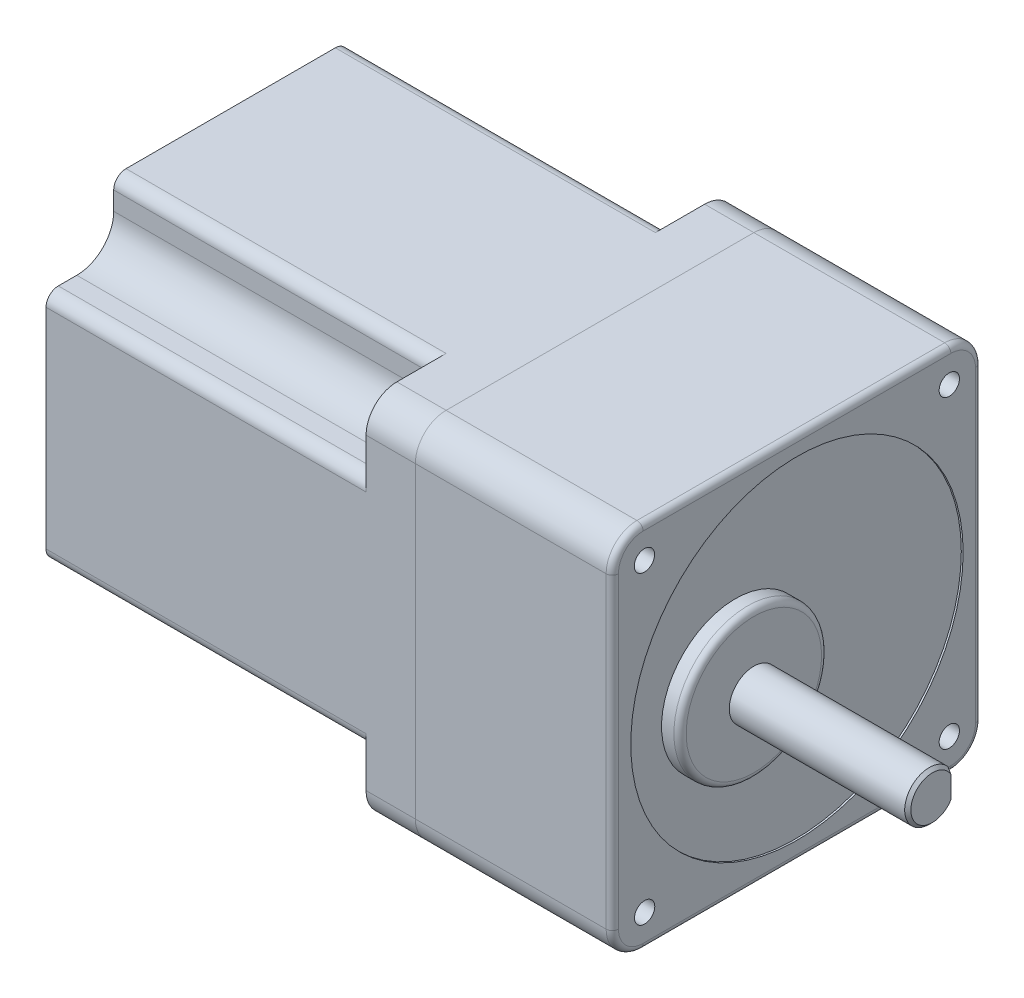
ISO-10303-21;
HEADER;
FILE_DESCRIPTION(('STEP AP214'),'2;1');
FILE_NAME('part.step','',(''),(''),'','','');
FILE_SCHEMA(('AUTOMOTIVE_DESIGN { 1 0 10303 214 1 1 1 1 }'));
ENDSEC;
DATA;
#1=APPLICATION_CONTEXT('core data for automotive mechanical design processes');
#2=APPLICATION_PROTOCOL_DEFINITION('international standard','automotive_design',2000,#1);
#3=PRODUCT_CONTEXT('',#1,'mechanical');
#4=PRODUCT('Part','Part','',(#3));
#5=PRODUCT_RELATED_PRODUCT_CATEGORY('part','',(#4));
#6=PRODUCT_DEFINITION_FORMATION('','',#4);
#7=PRODUCT_DEFINITION_CONTEXT('part definition',#1,'design');
#8=PRODUCT_DEFINITION('design','',#6,#7);
#9=PRODUCT_DEFINITION_SHAPE('','',#8);
#10=(LENGTH_UNIT() NAMED_UNIT(*) SI_UNIT(.MILLI.,.METRE.));
#11=(NAMED_UNIT(*) PLANE_ANGLE_UNIT() SI_UNIT($,.RADIAN.));
#12=(NAMED_UNIT(*) SI_UNIT($,.STERADIAN.) SOLID_ANGLE_UNIT());
#13=UNCERTAINTY_MEASURE_WITH_UNIT(LENGTH_MEASURE(1.E-05),#10,'distance_accuracy_value','');
#14=(GEOMETRIC_REPRESENTATION_CONTEXT(3) GLOBAL_UNCERTAINTY_ASSIGNED_CONTEXT((#13)) GLOBAL_UNIT_ASSIGNED_CONTEXT((#10,
#11,#12)) REPRESENTATION_CONTEXT('',''));
#15=CARTESIAN_POINT('',(0.,0.,0.));
#16=DIRECTION('',(0.,0.,1.));
#17=DIRECTION('',(1.,0.,0.));
#18=AXIS2_PLACEMENT_3D('',#15,#16,#17);
#19=CARTESIAN_POINT('',(31.7,0.,0.));
#20=DIRECTION('',(1.,0.,0.));
#21=DIRECTION('',(0.,0.,-1.));
#22=AXIS2_PLACEMENT_3D('',#19,#20,#21);
#23=CYLINDRICAL_SURFACE('',#22,27.);
#24=CARTESIAN_POINT('',(31.7,0.,0.));
#25=DIRECTION('',(1.,0.,0.));
#26=DIRECTION('',(0.,0.,-1.));
#27=AXIS2_PLACEMENT_3D('',#24,#25,#26);
#28=CIRCLE('',#27,27.);
#29=CARTESIAN_POINT('',(31.7,0.,-27.));
#30=VERTEX_POINT('',#29);
#31=EDGE_CURVE('E190',#30,#30,#28,.T.);
#32=ORIENTED_EDGE('',*,*,#31,.F.);
#33=EDGE_LOOP('',(#32));
#34=FACE_BOUND('',#33,.T.);
#35=CARTESIAN_POINT('',(32.,0.,0.));
#36=DIRECTION('',(1.,0.,0.));
#37=DIRECTION('',(0.,0.,-1.));
#38=AXIS2_PLACEMENT_3D('',#35,#36,#37);
#39=CIRCLE('',#38,27.);
#40=CARTESIAN_POINT('',(32.,0.,-27.));
#41=VERTEX_POINT('',#40);
#42=EDGE_CURVE('E217',#41,#41,#39,.T.);
#43=ORIENTED_EDGE('',*,*,#42,.T.);
#44=EDGE_LOOP('',(#43));
#45=FACE_BOUND('',#44,.T.);
#46=ADVANCED_FACE('F50',(#34,#45),#23,.F.);
#47=CARTESIAN_POINT('',(31.7,0.,0.));
#48=DIRECTION('',(1.,0.,0.));
#49=DIRECTION('',(0.,0.,-1.));
#50=AXIS2_PLACEMENT_3D('',#47,#48,#49);
#51=PLANE('',#50);
#52=ORIENTED_EDGE('',*,*,#31,.T.);
#53=EDGE_LOOP('',(#52));
#54=FACE_BOUND('',#53,.T.);
#55=ADVANCED_FACE('F375',(#54),#51,.T.);
#56=CARTESIAN_POINT('',(20.,24.7487373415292,-24.7487373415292));
#57=DIRECTION('',(-1.,0.,0.));
#58=DIRECTION('',(0.,0.,1.));
#59=AXIS2_PLACEMENT_3D('',#56,#57,#58);
#60=CYLINDRICAL_SURFACE('',#59,3.);
#61=CARTESIAN_POINT('',(20.,24.7487373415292,-24.7487373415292));
#62=DIRECTION('',(-1.,0.,0.));
#63=DIRECTION('',(0.,0.,1.));
#64=AXIS2_PLACEMENT_3D('',#61,#62,#63);
#65=CIRCLE('',#64,3.);
#66=CARTESIAN_POINT('',(20.,24.7487373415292,-21.7487373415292));
#67=VERTEX_POINT('',#66);
#68=EDGE_CURVE('E185',#67,#67,#65,.T.);
#69=ORIENTED_EDGE('',*,*,#68,.F.);
#70=EDGE_LOOP('',(#69));
#71=FACE_BOUND('',#70,.T.);
#72=CARTESIAN_POINT('',(0.,24.7487373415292,-24.7487373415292));
#73=DIRECTION('',(-1.,0.,0.));
#74=DIRECTION('',(0.,0.,1.));
#75=AXIS2_PLACEMENT_3D('',#72,#73,#74);
#76=CIRCLE('',#75,3.);
#77=CARTESIAN_POINT('',(0.,24.7487373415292,-21.7487373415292));
#78=VERTEX_POINT('',#77);
#79=EDGE_CURVE('E186',#78,#78,#76,.T.);
#80=ORIENTED_EDGE('',*,*,#79,.T.);
#81=EDGE_LOOP('',(#80));
#82=FACE_BOUND('',#81,.T.);
#83=ADVANCED_FACE('F381',(#71,#82),#60,.F.);
#84=CARTESIAN_POINT('',(20.,24.7487373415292,24.7487373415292));
#85=DIRECTION('',(-1.,0.,0.));
#86=DIRECTION('',(0.,0.,1.));
#87=AXIS2_PLACEMENT_3D('',#84,#85,#86);
#88=CYLINDRICAL_SURFACE('',#87,3.);
#89=CARTESIAN_POINT('',(20.,24.7487373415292,24.7487373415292));
#90=DIRECTION('',(-1.,0.,0.));
#91=DIRECTION('',(0.,0.,1.));
#92=AXIS2_PLACEMENT_3D('',#89,#90,#91);
#93=CIRCLE('',#92,3.);
#94=CARTESIAN_POINT('',(20.,24.7487373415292,27.7487373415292));
#95=VERTEX_POINT('',#94);
#96=EDGE_CURVE('E196',#95,#95,#93,.T.);
#97=ORIENTED_EDGE('',*,*,#96,.F.);
#98=EDGE_LOOP('',(#97));
#99=FACE_BOUND('',#98,.T.);
#100=CARTESIAN_POINT('',(0.,24.7487373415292,24.7487373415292));
#101=DIRECTION('',(-1.,0.,0.));
#102=DIRECTION('',(0.,0.,1.));
#103=AXIS2_PLACEMENT_3D('',#100,#101,#102);
#104=CIRCLE('',#103,3.);
#105=CARTESIAN_POINT('',(0.,24.7487373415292,27.7487373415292));
#106=VERTEX_POINT('',#105);
#107=EDGE_CURVE('E189',#106,#106,#104,.T.);
#108=ORIENTED_EDGE('',*,*,#107,.T.);
#109=EDGE_LOOP('',(#108));
#110=FACE_BOUND('',#109,.T.);
#111=ADVANCED_FACE('F568',(#99,#110),#88,.F.);
#112=CARTESIAN_POINT('',(20.,-24.7487373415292,24.7487373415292));
#113=DIRECTION('',(-1.,0.,0.));
#114=DIRECTION('',(0.,0.,1.));
#115=AXIS2_PLACEMENT_3D('',#112,#113,#114);
#116=CYLINDRICAL_SURFACE('',#115,3.);
#117=CARTESIAN_POINT('',(20.,-24.7487373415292,24.7487373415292));
#118=DIRECTION('',(-1.,0.,0.));
#119=DIRECTION('',(0.,0.,1.));
#120=AXIS2_PLACEMENT_3D('',#117,#118,#119);
#121=CIRCLE('',#120,3.);
#122=CARTESIAN_POINT('',(20.,-24.7487373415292,27.7487373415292));
#123=VERTEX_POINT('',#122);
#124=EDGE_CURVE('E205',#123,#123,#121,.T.);
#125=ORIENTED_EDGE('',*,*,#124,.F.);
#126=EDGE_LOOP('',(#125));
#127=FACE_BOUND('',#126,.T.);
#128=CARTESIAN_POINT('',(0.,-24.7487373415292,24.7487373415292));
#129=DIRECTION('',(-1.,0.,0.));
#130=DIRECTION('',(0.,0.,1.));
#131=AXIS2_PLACEMENT_3D('',#128,#129,#130);
#132=CIRCLE('',#131,3.);
#133=CARTESIAN_POINT('',(0.,-24.7487373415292,27.7487373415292));
#134=VERTEX_POINT('',#133);
#135=EDGE_CURVE('E199',#134,#134,#132,.T.);
#136=ORIENTED_EDGE('',*,*,#135,.T.);
#137=EDGE_LOOP('',(#136));
#138=FACE_BOUND('',#137,.T.);
#139=ADVANCED_FACE('F559',(#127,#138),#116,.F.);
#140=CARTESIAN_POINT('',(20.,-24.7487373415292,-24.7487373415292));
#141=DIRECTION('',(-1.,0.,0.));
#142=DIRECTION('',(0.,0.,1.));
#143=AXIS2_PLACEMENT_3D('',#140,#141,#142);
#144=CYLINDRICAL_SURFACE('',#143,3.);
#145=CARTESIAN_POINT('',(20.,-24.7487373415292,-24.7487373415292));
#146=DIRECTION('',(-1.,0.,0.));
#147=DIRECTION('',(0.,0.,1.));
#148=AXIS2_PLACEMENT_3D('',#145,#146,#147);
#149=CIRCLE('',#148,3.);
#150=CARTESIAN_POINT('',(20.,-24.7487373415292,-21.7487373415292));
#151=VERTEX_POINT('',#150);
#152=EDGE_CURVE('E184',#151,#151,#149,.T.);
#153=ORIENTED_EDGE('',*,*,#152,.F.);
#154=EDGE_LOOP('',(#153));
#155=FACE_BOUND('',#154,.T.);
#156=CARTESIAN_POINT('',(0.,-24.7487373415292,-24.7487373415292));
#157=DIRECTION('',(-1.,0.,0.));
#158=DIRECTION('',(0.,0.,1.));
#159=AXIS2_PLACEMENT_3D('',#156,#157,#158);
#160=CIRCLE('',#159,3.);
#161=CARTESIAN_POINT('',(0.,-24.7487373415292,-21.7487373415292));
#162=VERTEX_POINT('',#161);
#163=EDGE_CURVE('E202',#162,#162,#160,.T.);
#164=ORIENTED_EDGE('',*,*,#163,.T.);
#165=EDGE_LOOP('',(#164));
#166=FACE_BOUND('',#165,.T.);
#167=ADVANCED_FACE('F549',(#155,#166),#144,.F.);
#168=CARTESIAN_POINT('',(20.,24.7487373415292,24.7487373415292));
#169=DIRECTION('',(-1.,0.,0.));
#170=DIRECTION('',(0.,0.,1.));
#171=AXIS2_PLACEMENT_3D('',#168,#169,#170);
#172=PLANE('',#171);
#173=ORIENTED_EDGE('',*,*,#96,.T.);
#174=EDGE_LOOP('',(#173));
#175=FACE_BOUND('',#174,.T.);
#176=CARTESIAN_POINT('',(20.,24.7793364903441,24.7793364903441));
#177=DIRECTION('',(-1.,0.,0.));
#178=DIRECTION('',(0.,0.,1.));
#179=AXIS2_PLACEMENT_3D('',#176,#177,#178);
#180=CIRCLE('',#179,1.65);
#181=CARTESIAN_POINT('',(20.,24.7793364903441,26.4293364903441));
#182=VERTEX_POINT('',#181);
#183=EDGE_CURVE('E193',#182,#182,#180,.F.);
#184=ORIENTED_EDGE('',*,*,#183,.T.);
#185=EDGE_LOOP('',(#184));
#186=FACE_BOUND('',#185,.T.);
#187=ADVANCED_FACE('F539',(#175,#186),#172,.T.);
#188=CARTESIAN_POINT('',(20.,24.7487373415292,-24.7487373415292));
#189=DIRECTION('',(-1.,0.,0.));
#190=DIRECTION('',(0.,0.,1.));
#191=AXIS2_PLACEMENT_3D('',#188,#189,#190);
#192=PLANE('',#191);
#193=ORIENTED_EDGE('',*,*,#68,.T.);
#194=EDGE_LOOP('',(#193));
#195=FACE_BOUND('',#194,.T.);
#196=CARTESIAN_POINT('',(20.,24.7487373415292,-24.7487373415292));
#197=DIRECTION('',(-1.,0.,0.));
#198=DIRECTION('',(0.,0.,1.));
#199=AXIS2_PLACEMENT_3D('',#196,#197,#198);
#200=CIRCLE('',#199,1.65);
#201=CARTESIAN_POINT('',(20.,24.7487373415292,-23.0987373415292));
#202=VERTEX_POINT('',#201);
#203=EDGE_CURVE('E181',#202,#202,#200,.F.);
#204=ORIENTED_EDGE('',*,*,#203,.T.);
#205=EDGE_LOOP('',(#204));
#206=FACE_BOUND('',#205,.T.);
#207=ADVANCED_FACE('F530',(#195,#206),#192,.T.);
#208=CARTESIAN_POINT('',(20.,-24.7487373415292,-24.7487373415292));
#209=DIRECTION('',(-1.,0.,0.));
#210=DIRECTION('',(0.,0.,1.));
#211=AXIS2_PLACEMENT_3D('',#208,#209,#210);
#212=PLANE('',#211);
#213=ORIENTED_EDGE('',*,*,#152,.T.);
#214=EDGE_LOOP('',(#213));
#215=FACE_BOUND('',#214,.T.);
#216=CARTESIAN_POINT('',(20.,-24.7487373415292,-24.7487373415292));
#217=DIRECTION('',(-1.,0.,0.));
#218=DIRECTION('',(0.,0.,1.));
#219=AXIS2_PLACEMENT_3D('',#216,#217,#218);
#220=CIRCLE('',#219,1.65);
#221=CARTESIAN_POINT('',(20.,-24.7487373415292,-23.0987373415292));
#222=VERTEX_POINT('',#221);
#223=EDGE_CURVE('E210',#222,#222,#220,.F.);
#224=ORIENTED_EDGE('',*,*,#223,.T.);
#225=EDGE_LOOP('',(#224));
#226=FACE_BOUND('',#225,.T.);
#227=ADVANCED_FACE('F387',(#215,#226),#212,.T.);
#228=CARTESIAN_POINT('',(20.,-24.7487373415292,24.7487373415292));
#229=DIRECTION('',(-1.,0.,0.));
#230=DIRECTION('',(0.,0.,1.));
#231=AXIS2_PLACEMENT_3D('',#228,#229,#230);
#232=PLANE('',#231);
#233=ORIENTED_EDGE('',*,*,#124,.T.);
#234=EDGE_LOOP('',(#233));
#235=FACE_BOUND('',#234,.T.);
#236=CARTESIAN_POINT('',(20.,-24.7487373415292,24.7487373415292));
#237=DIRECTION('',(-1.,0.,0.));
#238=DIRECTION('',(0.,0.,1.));
#239=AXIS2_PLACEMENT_3D('',#236,#237,#238);
#240=CIRCLE('',#239,1.65);
#241=CARTESIAN_POINT('',(20.,-24.7487373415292,26.3987373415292));
#242=VERTEX_POINT('',#241);
#243=EDGE_CURVE('E180',#242,#242,#240,.F.);
#244=ORIENTED_EDGE('',*,*,#243,.T.);
#245=EDGE_LOOP('',(#244));
#246=FACE_BOUND('',#245,.T.);
#247=ADVANCED_FACE('F369',(#235,#246),#232,.T.);
#248=CARTESIAN_POINT('',(0.,-25.,25.));
#249=DIRECTION('',(-1.,0.,0.));
#250=DIRECTION('',(0.,0.,1.));
#251=AXIS2_PLACEMENT_3D('',#248,#249,#250);
#252=PLANE('',#251);
#253=ORIENTED_EDGE('',*,*,#163,.F.);
#254=EDGE_LOOP('',(#253));
#255=FACE_BOUND('',#254,.T.);
#256=ORIENTED_EDGE('',*,*,#135,.F.);
#257=EDGE_LOOP('',(#256));
#258=FACE_BOUND('',#257,.T.);
#259=ORIENTED_EDGE('',*,*,#107,.F.);
#260=EDGE_LOOP('',(#259));
#261=FACE_BOUND('',#260,.T.);
#262=ORIENTED_EDGE('',*,*,#79,.F.);
#263=EDGE_LOOP('',(#262));
#264=FACE_BOUND('',#263,.T.);
#265=CARTESIAN_POINT('',(0.,-25.,25.));
#266=DIRECTION('',(1.,0.,0.));
#267=DIRECTION('',(0.,0.,1.));
#268=AXIS2_PLACEMENT_3D('',#265,#266,#267);
#269=CIRCLE('',#268,5.);
#270=CARTESIAN_POINT('',(0.,-25.,30.));
#271=VERTEX_POINT('',#270);
#272=CARTESIAN_POINT('',(0.,-30.,25.));
#273=VERTEX_POINT('',#272);
#274=EDGE_CURVE('E144',#271,#273,#269,.T.);
#275=ORIENTED_EDGE('',*,*,#274,.F.);
#276=DIRECTION('',(0.,-1.,0.));
#277=VECTOR('',#276,1.);
#278=CARTESIAN_POINT('',(0.,-25.,30.));
#279=LINE('',#278,#277);
#280=CARTESIAN_POINT('',(0.,25.,30.));
#281=VERTEX_POINT('',#280);
#282=EDGE_CURVE('E150',#281,#271,#279,.T.);
#283=ORIENTED_EDGE('',*,*,#282,.F.);
#284=CARTESIAN_POINT('',(0.,25.,25.));
#285=DIRECTION('',(1.,0.,0.));
#286=DIRECTION('',(0.,0.,1.));
#287=AXIS2_PLACEMENT_3D('',#284,#285,#286);
#288=CIRCLE('',#287,5.);
#289=CARTESIAN_POINT('',(0.,30.,25.));
#290=VERTEX_POINT('',#289);
#291=EDGE_CURVE('E307',#290,#281,#288,.T.);
#292=ORIENTED_EDGE('',*,*,#291,.F.);
#293=DIRECTION('',(0.,0.,1.));
#294=VECTOR('',#293,1.);
#295=CARTESIAN_POINT('',(0.,30.,25.));
#296=LINE('',#295,#294);
#297=CARTESIAN_POINT('',(0.,30.,-25.));
#298=VERTEX_POINT('',#297);
#299=EDGE_CURVE('E304',#298,#290,#296,.T.);
#300=ORIENTED_EDGE('',*,*,#299,.F.);
#301=CARTESIAN_POINT('',(0.,25.,-25.));
#302=DIRECTION('',(1.,0.,0.));
#303=DIRECTION('',(0.,0.,1.));
#304=AXIS2_PLACEMENT_3D('',#301,#302,#303);
#305=CIRCLE('',#304,5.);
#306=CARTESIAN_POINT('',(0.,25.,-30.));
#307=VERTEX_POINT('',#306);
#308=EDGE_CURVE('E295',#307,#298,#305,.T.);
#309=ORIENTED_EDGE('',*,*,#308,.F.);
#310=DIRECTION('',(0.,1.,0.));
#311=VECTOR('',#310,1.);
#312=CARTESIAN_POINT('',(0.,-25.,-30.));
#313=LINE('',#312,#311);
#314=CARTESIAN_POINT('',(0.,-25.,-30.));
#315=VERTEX_POINT('',#314);
#316=EDGE_CURVE('E293',#315,#307,#313,.T.);
#317=ORIENTED_EDGE('',*,*,#316,.F.);
#318=CARTESIAN_POINT('',(0.,-25.,-25.));
#319=DIRECTION('',(1.,0.,0.));
#320=DIRECTION('',(0.,0.,-1.));
#321=AXIS2_PLACEMENT_3D('',#318,#319,#320);
#322=CIRCLE('',#321,5.);
#323=CARTESIAN_POINT('',(0.,-30.,-25.));
#324=VERTEX_POINT('',#323);
#325=EDGE_CURVE('E311',#324,#315,#322,.T.);
#326=ORIENTED_EDGE('',*,*,#325,.F.);
#327=DIRECTION('',(0.,0.,-1.));
#328=VECTOR('',#327,1.);
#329=CARTESIAN_POINT('',(0.,-30.,25.));
#330=LINE('',#329,#328);
#331=EDGE_CURVE('E162',#273,#324,#330,.T.);
#332=ORIENTED_EDGE('',*,*,#331,.F.);
#333=EDGE_LOOP('',(#275,#283,#292,#300,#309,#317,#326,#332));
#334=FACE_BOUND('',#333,.T.);
#335=ADVANCED_FACE('F159',(#255,#258,#261,#264,#334),#252,.T.);
#336=CARTESIAN_POINT('',(32.,24.7793364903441,24.7793364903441));
#337=DIRECTION('',(1.,0.,0.));
#338=DIRECTION('',(0.,0.,-1.));
#339=AXIS2_PLACEMENT_3D('',#336,#337,#338);
#340=CYLINDRICAL_SURFACE('',#339,1.65);
#341=ORIENTED_EDGE('',*,*,#183,.F.);
#342=EDGE_LOOP('',(#341));
#343=FACE_BOUND('',#342,.T.);
#344=CARTESIAN_POINT('',(32.,24.7793364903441,24.7793364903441));
#345=DIRECTION('',(1.,0.,0.));
#346=DIRECTION('',(0.,0.,-1.));
#347=AXIS2_PLACEMENT_3D('',#344,#345,#346);
#348=CIRCLE('',#347,1.65);
#349=CARTESIAN_POINT('',(32.,24.7793364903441,23.1293364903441));
#350=VERTEX_POINT('',#349);
#351=EDGE_CURVE('E177',#350,#350,#348,.T.);
#352=ORIENTED_EDGE('',*,*,#351,.T.);
#353=EDGE_LOOP('',(#352));
#354=FACE_BOUND('',#353,.T.);
#355=ADVANCED_FACE('F357',(#343,#354),#340,.F.);
#356=CARTESIAN_POINT('',(32.,24.7487373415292,-24.7487373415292));
#357=DIRECTION('',(1.,0.,0.));
#358=DIRECTION('',(0.,0.,-1.));
#359=AXIS2_PLACEMENT_3D('',#356,#357,#358);
#360=CYLINDRICAL_SURFACE('',#359,1.65);
#361=ORIENTED_EDGE('',*,*,#203,.F.);
#362=EDGE_LOOP('',(#361));
#363=FACE_BOUND('',#362,.T.);
#364=CARTESIAN_POINT('',(32.,24.7487373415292,-24.7487373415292));
#365=DIRECTION('',(1.,0.,0.));
#366=DIRECTION('',(0.,0.,-1.));
#367=AXIS2_PLACEMENT_3D('',#364,#365,#366);
#368=CIRCLE('',#367,1.65);
#369=CARTESIAN_POINT('',(32.,24.7487373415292,-26.3987373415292));
#370=VERTEX_POINT('',#369);
#371=EDGE_CURVE('E174',#370,#370,#368,.T.);
#372=ORIENTED_EDGE('',*,*,#371,.T.);
#373=EDGE_LOOP('',(#372));
#374=FACE_BOUND('',#373,.T.);
#375=ADVANCED_FACE('F359',(#363,#374),#360,.F.);
#376=CARTESIAN_POINT('',(32.,-24.7487373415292,-24.7487373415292));
#377=DIRECTION('',(1.,0.,0.));
#378=DIRECTION('',(0.,0.,-1.));
#379=AXIS2_PLACEMENT_3D('',#376,#377,#378);
#380=CYLINDRICAL_SURFACE('',#379,1.65);
#381=ORIENTED_EDGE('',*,*,#223,.F.);
#382=EDGE_LOOP('',(#381));
#383=FACE_BOUND('',#382,.T.);
#384=CARTESIAN_POINT('',(32.,-24.7487373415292,-24.7487373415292));
#385=DIRECTION('',(1.,0.,0.));
#386=DIRECTION('',(0.,0.,-1.));
#387=AXIS2_PLACEMENT_3D('',#384,#385,#386);
#388=CIRCLE('',#387,1.65);
#389=CARTESIAN_POINT('',(32.,-24.7487373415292,-26.3987373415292));
#390=VERTEX_POINT('',#389);
#391=EDGE_CURVE('E171',#390,#390,#388,.T.);
#392=ORIENTED_EDGE('',*,*,#391,.T.);
#393=EDGE_LOOP('',(#392));
#394=FACE_BOUND('',#393,.T.);
#395=ADVANCED_FACE('F366',(#383,#394),#380,.F.);
#396=CARTESIAN_POINT('',(32.,-24.7487373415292,24.7487373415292));
#397=DIRECTION('',(1.,0.,0.));
#398=DIRECTION('',(0.,0.,-1.));
#399=AXIS2_PLACEMENT_3D('',#396,#397,#398);
#400=CYLINDRICAL_SURFACE('',#399,1.65);
#401=ORIENTED_EDGE('',*,*,#243,.F.);
#402=EDGE_LOOP('',(#401));
#403=FACE_BOUND('',#402,.T.);
#404=CARTESIAN_POINT('',(32.,-24.7487373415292,24.7487373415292));
#405=DIRECTION('',(1.,0.,0.));
#406=DIRECTION('',(0.,0.,-1.));
#407=AXIS2_PLACEMENT_3D('',#404,#405,#406);
#408=CIRCLE('',#407,1.65);
#409=CARTESIAN_POINT('',(32.,-24.7487373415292,23.0987373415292));
#410=VERTEX_POINT('',#409);
#411=EDGE_CURVE('E156',#410,#410,#408,.T.);
#412=ORIENTED_EDGE('',*,*,#411,.T.);
#413=EDGE_LOOP('',(#412));
#414=FACE_BOUND('',#413,.T.);
#415=ADVANCED_FACE('F480',(#403,#414),#400,.F.);
#416=CARTESIAN_POINT('',(32.,-25.,30.));
#417=DIRECTION('',(0.,0.,-1.));
#418=DIRECTION('',(-1.,0.,0.));
#419=AXIS2_PLACEMENT_3D('',#416,#417,#418);
#420=PLANE('',#419);
#421=DIRECTION('',(-1.,0.,0.));
#422=VECTOR('',#421,1.);
#423=CARTESIAN_POINT('',(32.,-25.,30.));
#424=LINE('',#423,#422);
#425=CARTESIAN_POINT('',(31.,-25.,30.));
#426=VERTEX_POINT('',#425);
#427=EDGE_CURVE('E139',#426,#271,#424,.T.);
#428=ORIENTED_EDGE('',*,*,#427,.F.);
#429=DIRECTION('',(0.,-1.,0.));
#430=VECTOR('',#429,1.);
#431=CARTESIAN_POINT('',(31.,-25.,30.));
#432=LINE('',#431,#430);
#433=CARTESIAN_POINT('',(31.,25.,30.));
#434=VERTEX_POINT('',#433);
#435=EDGE_CURVE('E59',#426,#434,#432,.F.);
#436=ORIENTED_EDGE('',*,*,#435,.T.);
#437=DIRECTION('',(-1.,0.,0.));
#438=VECTOR('',#437,1.);
#439=CARTESIAN_POINT('',(32.,25.,30.));
#440=LINE('',#439,#438);
#441=EDGE_CURVE('E152',#434,#281,#440,.T.);
#442=ORIENTED_EDGE('',*,*,#441,.T.);
#443=ORIENTED_EDGE('',*,*,#282,.T.);
#444=EDGE_LOOP('',(#428,#436,#442,#443));
#445=FACE_BOUND('',#444,.T.);
#446=ADVANCED_FACE('F151',(#445),#420,.F.);
#447=CARTESIAN_POINT('',(32.,25.,25.));
#448=DIRECTION('',(-1.,0.,0.));
#449=DIRECTION('',(0.,0.,1.));
#450=AXIS2_PLACEMENT_3D('',#447,#448,#449);
#451=CYLINDRICAL_SURFACE('',#450,5.);
#452=ORIENTED_EDGE('',*,*,#441,.F.);
#453=CARTESIAN_POINT('',(31.,25.,25.));
#454=DIRECTION('',(-1.,0.,0.));
#455=DIRECTION('',(0.,0.,1.));
#456=AXIS2_PLACEMENT_3D('',#453,#454,#455);
#457=CIRCLE('',#456,5.);
#458=CARTESIAN_POINT('',(31.,30.,25.));
#459=VERTEX_POINT('',#458);
#460=EDGE_CURVE('E12',#434,#459,#457,.T.);
#461=ORIENTED_EDGE('',*,*,#460,.T.);
#462=DIRECTION('',(-1.,0.,0.));
#463=VECTOR('',#462,1.);
#464=CARTESIAN_POINT('',(32.,30.,25.));
#465=LINE('',#464,#463);
#466=EDGE_CURVE('E305',#459,#290,#465,.T.);
#467=ORIENTED_EDGE('',*,*,#466,.T.);
#468=ORIENTED_EDGE('',*,*,#291,.T.);
#469=EDGE_LOOP('',(#452,#461,#467,#468));
#470=FACE_BOUND('',#469,.T.);
#471=ADVANCED_FACE('F462',(#470),#451,.T.);
#472=CARTESIAN_POINT('',(32.,30.,25.));
#473=DIRECTION('',(0.,-1.,0.));
#474=DIRECTION('',(0.,0.,-1.));
#475=AXIS2_PLACEMENT_3D('',#472,#473,#474);
#476=PLANE('',#475);
#477=ORIENTED_EDGE('',*,*,#466,.F.);
#478=DIRECTION('',(0.,0.,1.));
#479=VECTOR('',#478,1.);
#480=CARTESIAN_POINT('',(31.,30.,25.));
#481=LINE('',#480,#479);
#482=CARTESIAN_POINT('',(31.,30.,-25.));
#483=VERTEX_POINT('',#482);
#484=EDGE_CURVE('E247',#459,#483,#481,.F.);
#485=ORIENTED_EDGE('',*,*,#484,.T.);
#486=DIRECTION('',(-1.,0.,0.));
#487=VECTOR('',#486,1.);
#488=CARTESIAN_POINT('',(32.,30.,-25.));
#489=LINE('',#488,#487);
#490=EDGE_CURVE('E288',#483,#298,#489,.T.);
#491=ORIENTED_EDGE('',*,*,#490,.T.);
#492=ORIENTED_EDGE('',*,*,#299,.T.);
#493=EDGE_LOOP('',(#477,#485,#491,#492));
#494=FACE_BOUND('',#493,.T.);
#495=ADVANCED_FACE('F453',(#494),#476,.F.);
#496=CARTESIAN_POINT('',(32.,25.,-25.));
#497=DIRECTION('',(-1.,0.,0.));
#498=DIRECTION('',(0.,0.,1.));
#499=AXIS2_PLACEMENT_3D('',#496,#497,#498);
#500=CYLINDRICAL_SURFACE('',#499,5.);
#501=ORIENTED_EDGE('',*,*,#490,.F.);
#502=CARTESIAN_POINT('',(31.,25.,-25.));
#503=DIRECTION('',(-1.,0.,0.));
#504=DIRECTION('',(0.,0.,1.));
#505=AXIS2_PLACEMENT_3D('',#502,#503,#504);
#506=CIRCLE('',#505,5.);
#507=CARTESIAN_POINT('',(31.,25.,-30.));
#508=VERTEX_POINT('',#507);
#509=EDGE_CURVE('E245',#483,#508,#506,.T.);
#510=ORIENTED_EDGE('',*,*,#509,.T.);
#511=DIRECTION('',(-1.,0.,0.));
#512=VECTOR('',#511,1.);
#513=CARTESIAN_POINT('',(32.,25.,-30.));
#514=LINE('',#513,#512);
#515=EDGE_CURVE('E286',#508,#307,#514,.T.);
#516=ORIENTED_EDGE('',*,*,#515,.T.);
#517=ORIENTED_EDGE('',*,*,#308,.T.);
#518=EDGE_LOOP('',(#501,#510,#516,#517));
#519=FACE_BOUND('',#518,.T.);
#520=ADVANCED_FACE('F284',(#519),#500,.T.);
#521=CARTESIAN_POINT('',(32.,-25.,-30.));
#522=DIRECTION('',(0.,0.,1.));
#523=DIRECTION('',(1.,0.,0.));
#524=AXIS2_PLACEMENT_3D('',#521,#522,#523);
#525=PLANE('',#524);
#526=ORIENTED_EDGE('',*,*,#515,.F.);
#527=DIRECTION('',(0.,1.,0.));
#528=VECTOR('',#527,1.);
#529=CARTESIAN_POINT('',(31.,-25.,-30.));
#530=LINE('',#529,#528);
#531=CARTESIAN_POINT('',(31.,-25.,-30.));
#532=VERTEX_POINT('',#531);
#533=EDGE_CURVE('E243',#508,#532,#530,.F.);
#534=ORIENTED_EDGE('',*,*,#533,.T.);
#535=DIRECTION('',(-1.,0.,0.));
#536=VECTOR('',#535,1.);
#537=CARTESIAN_POINT('',(32.,-25.,-30.));
#538=LINE('',#537,#536);
#539=EDGE_CURVE('E297',#532,#315,#538,.T.);
#540=ORIENTED_EDGE('',*,*,#539,.T.);
#541=ORIENTED_EDGE('',*,*,#316,.T.);
#542=EDGE_LOOP('',(#526,#534,#540,#541));
#543=FACE_BOUND('',#542,.T.);
#544=ADVANCED_FACE('F290',(#543),#525,.F.);
#545=CARTESIAN_POINT('',(32.,-25.,-25.));
#546=DIRECTION('',(-1.,0.,0.));
#547=DIRECTION('',(0.,0.,1.));
#548=AXIS2_PLACEMENT_3D('',#545,#546,#547);
#549=CYLINDRICAL_SURFACE('',#548,5.);
#550=ORIENTED_EDGE('',*,*,#539,.F.);
#551=CARTESIAN_POINT('',(31.,-25.,-25.));
#552=DIRECTION('',(-1.,0.,0.));
#553=DIRECTION('',(0.,0.,1.));
#554=AXIS2_PLACEMENT_3D('',#551,#552,#553);
#555=CIRCLE('',#554,5.);
#556=CARTESIAN_POINT('',(31.,-30.,-25.));
#557=VERTEX_POINT('',#556);
#558=EDGE_CURVE('E241',#532,#557,#555,.T.);
#559=ORIENTED_EDGE('',*,*,#558,.T.);
#560=DIRECTION('',(-1.,0.,0.));
#561=VECTOR('',#560,1.);
#562=CARTESIAN_POINT('',(32.,-30.,-25.));
#563=LINE('',#562,#561);
#564=EDGE_CURVE('E313',#557,#324,#563,.T.);
#565=ORIENTED_EDGE('',*,*,#564,.T.);
#566=ORIENTED_EDGE('',*,*,#325,.T.);
#567=EDGE_LOOP('',(#550,#559,#565,#566));
#568=FACE_BOUND('',#567,.T.);
#569=ADVANCED_FACE('F316',(#568),#549,.T.);
#570=CARTESIAN_POINT('',(32.,-30.,25.));
#571=DIRECTION('',(0.,1.,0.));
#572=DIRECTION('',(0.,0.,1.));
#573=AXIS2_PLACEMENT_3D('',#570,#571,#572);
#574=PLANE('',#573);
#575=ORIENTED_EDGE('',*,*,#564,.F.);
#576=DIRECTION('',(0.,0.,-1.));
#577=VECTOR('',#576,1.);
#578=CARTESIAN_POINT('',(31.,-30.,25.));
#579=LINE('',#578,#577);
#580=CARTESIAN_POINT('',(31.,-30.,25.));
#581=VERTEX_POINT('',#580);
#582=EDGE_CURVE('E239',#557,#581,#579,.F.);
#583=ORIENTED_EDGE('',*,*,#582,.T.);
#584=DIRECTION('',(-1.,0.,0.));
#585=VECTOR('',#584,1.);
#586=CARTESIAN_POINT('',(32.,-30.,25.));
#587=LINE('',#586,#585);
#588=EDGE_CURVE('E163',#581,#273,#587,.T.);
#589=ORIENTED_EDGE('',*,*,#588,.T.);
#590=ORIENTED_EDGE('',*,*,#331,.T.);
#591=EDGE_LOOP('',(#575,#583,#589,#590));
#592=FACE_BOUND('',#591,.T.);
#593=ADVANCED_FACE('F330',(#592),#574,.F.);
#594=CARTESIAN_POINT('',(32.,-25.,25.));
#595=DIRECTION('',(-1.,0.,0.));
#596=DIRECTION('',(0.,0.,1.));
#597=AXIS2_PLACEMENT_3D('',#594,#595,#596);
#598=CYLINDRICAL_SURFACE('',#597,5.);
#599=ORIENTED_EDGE('',*,*,#588,.F.);
#600=CARTESIAN_POINT('',(31.,-25.,25.));
#601=DIRECTION('',(-1.,0.,0.));
#602=DIRECTION('',(0.,0.,1.));
#603=AXIS2_PLACEMENT_3D('',#600,#601,#602);
#604=CIRCLE('',#603,5.);
#605=EDGE_CURVE('E146',#581,#426,#604,.T.);
#606=ORIENTED_EDGE('',*,*,#605,.T.);
#607=ORIENTED_EDGE('',*,*,#427,.T.);
#608=ORIENTED_EDGE('',*,*,#274,.T.);
#609=EDGE_LOOP('',(#599,#606,#607,#608));
#610=FACE_BOUND('',#609,.T.);
#611=ADVANCED_FACE('F142',(#610),#598,.T.);
#612=CARTESIAN_POINT('',(32.,-25.,25.));
#613=DIRECTION('',(-1.,0.,0.));
#614=DIRECTION('',(0.,0.,1.));
#615=AXIS2_PLACEMENT_3D('',#612,#613,#614);
#616=PLANE('',#615);
#617=DIRECTION('',(0.,-1.,0.));
#618=VECTOR('',#617,1.);
#619=CARTESIAN_POINT('',(32.,-25.,29.));
#620=LINE('',#619,#618);
#621=CARTESIAN_POINT('',(32.,25.,29.));
#622=VERTEX_POINT('',#621);
#623=CARTESIAN_POINT('',(32.,-25.,29.));
#624=VERTEX_POINT('',#623);
#625=EDGE_CURVE('E223',#622,#624,#620,.T.);
#626=ORIENTED_EDGE('',*,*,#625,.T.);
#627=CARTESIAN_POINT('',(32.,-25.,25.));
#628=DIRECTION('',(-1.,0.,0.));
#629=DIRECTION('',(0.,0.,1.));
#630=AXIS2_PLACEMENT_3D('',#627,#628,#629);
#631=CIRCLE('',#630,4.);
#632=CARTESIAN_POINT('',(32.,-29.,25.));
#633=VERTEX_POINT('',#632);
#634=EDGE_CURVE('E235',#624,#633,#631,.F.);
#635=ORIENTED_EDGE('',*,*,#634,.T.);
#636=DIRECTION('',(0.,0.,-1.));
#637=VECTOR('',#636,1.);
#638=CARTESIAN_POINT('',(32.,-29.,25.));
#639=LINE('',#638,#637);
#640=CARTESIAN_POINT('',(32.,-29.,-25.));
#641=VERTEX_POINT('',#640);
#642=EDGE_CURVE('E233',#633,#641,#639,.T.);
#643=ORIENTED_EDGE('',*,*,#642,.T.);
#644=CARTESIAN_POINT('',(32.,-25.,-25.));
#645=DIRECTION('',(-1.,0.,0.));
#646=DIRECTION('',(0.,0.,1.));
#647=AXIS2_PLACEMENT_3D('',#644,#645,#646);
#648=CIRCLE('',#647,4.);
#649=CARTESIAN_POINT('',(32.,-25.,-29.));
#650=VERTEX_POINT('',#649);
#651=EDGE_CURVE('E231',#641,#650,#648,.F.);
#652=ORIENTED_EDGE('',*,*,#651,.T.);
#653=DIRECTION('',(0.,1.,0.));
#654=VECTOR('',#653,1.);
#655=CARTESIAN_POINT('',(32.,-25.,-29.));
#656=LINE('',#655,#654);
#657=CARTESIAN_POINT('',(32.,25.,-29.));
#658=VERTEX_POINT('',#657);
#659=EDGE_CURVE('E229',#650,#658,#656,.T.);
#660=ORIENTED_EDGE('',*,*,#659,.T.);
#661=CARTESIAN_POINT('',(32.,25.,-25.));
#662=DIRECTION('',(-1.,0.,0.));
#663=DIRECTION('',(0.,0.,1.));
#664=AXIS2_PLACEMENT_3D('',#661,#662,#663);
#665=CIRCLE('',#664,4.);
#666=CARTESIAN_POINT('',(32.,29.,-25.));
#667=VERTEX_POINT('',#666);
#668=EDGE_CURVE('E227',#658,#667,#665,.F.);
#669=ORIENTED_EDGE('',*,*,#668,.T.);
#670=DIRECTION('',(0.,0.,1.));
#671=VECTOR('',#670,1.);
#672=CARTESIAN_POINT('',(32.,29.,25.));
#673=LINE('',#672,#671);
#674=CARTESIAN_POINT('',(32.,29.,25.));
#675=VERTEX_POINT('',#674);
#676=EDGE_CURVE('E225',#667,#675,#673,.T.);
#677=ORIENTED_EDGE('',*,*,#676,.T.);
#678=CARTESIAN_POINT('',(32.,25.,25.));
#679=DIRECTION('',(-1.,0.,0.));
#680=DIRECTION('',(0.,0.,1.));
#681=AXIS2_PLACEMENT_3D('',#678,#679,#680);
#682=CIRCLE('',#681,4.);
#683=EDGE_CURVE('E147',#675,#622,#682,.F.);
#684=ORIENTED_EDGE('',*,*,#683,.T.);
#685=EDGE_LOOP('',(#626,#635,#643,#652,#660,#669,#677,#684));
#686=FACE_BOUND('',#685,.T.);
#687=ORIENTED_EDGE('',*,*,#42,.F.);
#688=EDGE_LOOP('',(#687));
#689=FACE_BOUND('',#688,.T.);
#690=ORIENTED_EDGE('',*,*,#411,.F.);
#691=EDGE_LOOP('',(#690));
#692=FACE_BOUND('',#691,.T.);
#693=ORIENTED_EDGE('',*,*,#391,.F.);
#694=EDGE_LOOP('',(#693));
#695=FACE_BOUND('',#694,.T.);
#696=ORIENTED_EDGE('',*,*,#371,.F.);
#697=EDGE_LOOP('',(#696));
#698=FACE_BOUND('',#697,.T.);
#699=ORIENTED_EDGE('',*,*,#351,.F.);
#700=EDGE_LOOP('',(#699));
#701=FACE_BOUND('',#700,.T.);
#702=ADVANCED_FACE('F343',(#686,#689,#692,#695,#698,#701),#616,.F.);
#703=CARTESIAN_POINT('',(31.,25.,-25.));
#704=DIRECTION('',(-1.,0.,0.));
#705=DIRECTION('',(0.,0.,1.));
#706=AXIS2_PLACEMENT_3D('',#703,#704,#705);
#707=TOROIDAL_SURFACE('',#706,4.,1.);
#708=CARTESIAN_POINT('',(31.,25.,-29.));
#709=DIRECTION('',(0.,-1.,0.));
#710=DIRECTION('',(0.,0.,-1.));
#711=AXIS2_PLACEMENT_3D('',#708,#709,#710);
#712=CIRCLE('',#711,1.);
#713=EDGE_CURVE('E265',#508,#658,#712,.T.);
#714=ORIENTED_EDGE('',*,*,#713,.F.);
#715=ORIENTED_EDGE('',*,*,#509,.F.);
#716=CARTESIAN_POINT('',(31.,29.,-25.));
#717=DIRECTION('',(0.,0.,1.));
#718=DIRECTION('',(0.,-1.,0.));
#719=AXIS2_PLACEMENT_3D('',#716,#717,#718);
#720=CIRCLE('',#719,1.);
#721=EDGE_CURVE('E54',#667,#483,#720,.T.);
#722=ORIENTED_EDGE('',*,*,#721,.F.);
#723=ORIENTED_EDGE('',*,*,#668,.F.);
#724=EDGE_LOOP('',(#714,#715,#722,#723));
#725=FACE_BOUND('',#724,.T.);
#726=ADVANCED_FACE('F52',(#725),#707,.T.);
#727=CARTESIAN_POINT('',(31.,29.,25.));
#728=DIRECTION('',(0.,0.,1.));
#729=DIRECTION('',(1.,0.,0.));
#730=AXIS2_PLACEMENT_3D('',#727,#728,#729);
#731=CYLINDRICAL_SURFACE('',#730,1.);
#732=ORIENTED_EDGE('',*,*,#721,.T.);
#733=ORIENTED_EDGE('',*,*,#484,.F.);
#734=CARTESIAN_POINT('',(31.,29.,25.));
#735=DIRECTION('',(0.,0.,1.));
#736=DIRECTION('',(1.,0.,0.));
#737=AXIS2_PLACEMENT_3D('',#734,#735,#736);
#738=CIRCLE('',#737,1.);
#739=EDGE_CURVE('E263',#675,#459,#738,.T.);
#740=ORIENTED_EDGE('',*,*,#739,.F.);
#741=ORIENTED_EDGE('',*,*,#676,.F.);
#742=EDGE_LOOP('',(#732,#733,#740,#741));
#743=FACE_BOUND('',#742,.T.);
#744=ADVANCED_FACE('F276',(#743),#731,.T.);
#745=CARTESIAN_POINT('',(31.,-25.,-29.));
#746=DIRECTION('',(0.,1.,0.));
#747=DIRECTION('',(0.,0.,1.));
#748=AXIS2_PLACEMENT_3D('',#745,#746,#747);
#749=CYLINDRICAL_SURFACE('',#748,1.);
#750=ORIENTED_EDGE('',*,*,#713,.T.);
#751=ORIENTED_EDGE('',*,*,#659,.F.);
#752=CARTESIAN_POINT('',(31.,-25.,-29.));
#753=DIRECTION('',(0.,-1.,0.));
#754=DIRECTION('',(1.,0.,0.));
#755=AXIS2_PLACEMENT_3D('',#752,#753,#754);
#756=CIRCLE('',#755,1.);
#757=EDGE_CURVE('E260',#532,#650,#756,.T.);
#758=ORIENTED_EDGE('',*,*,#757,.F.);
#759=ORIENTED_EDGE('',*,*,#533,.F.);
#760=EDGE_LOOP('',(#750,#751,#758,#759));
#761=FACE_BOUND('',#760,.T.);
#762=ADVANCED_FACE('F319',(#761),#749,.T.);
#763=CARTESIAN_POINT('',(31.,25.,25.));
#764=DIRECTION('',(-1.,0.,0.));
#765=DIRECTION('',(0.,0.,1.));
#766=AXIS2_PLACEMENT_3D('',#763,#764,#765);
#767=TOROIDAL_SURFACE('',#766,4.,1.);
#768=ORIENTED_EDGE('',*,*,#739,.T.);
#769=ORIENTED_EDGE('',*,*,#460,.F.);
#770=CARTESIAN_POINT('',(31.,25.,29.));
#771=DIRECTION('',(0.,-1.,0.));
#772=DIRECTION('',(0.,0.,-1.));
#773=AXIS2_PLACEMENT_3D('',#770,#771,#772);
#774=CIRCLE('',#773,1.);
#775=EDGE_CURVE('E257',#622,#434,#774,.T.);
#776=ORIENTED_EDGE('',*,*,#775,.F.);
#777=ORIENTED_EDGE('',*,*,#683,.F.);
#778=EDGE_LOOP('',(#768,#769,#776,#777));
#779=FACE_BOUND('',#778,.T.);
#780=ADVANCED_FACE('F341',(#779),#767,.T.);
#781=CARTESIAN_POINT('',(31.,-25.,-25.));
#782=DIRECTION('',(-1.,0.,0.));
#783=DIRECTION('',(0.,0.,1.));
#784=AXIS2_PLACEMENT_3D('',#781,#782,#783);
#785=TOROIDAL_SURFACE('',#784,4.,1.);
#786=ORIENTED_EDGE('',*,*,#757,.T.);
#787=ORIENTED_EDGE('',*,*,#651,.F.);
#788=CARTESIAN_POINT('',(31.,-29.,-25.));
#789=DIRECTION('',(0.,0.,1.));
#790=DIRECTION('',(0.,-1.,0.));
#791=AXIS2_PLACEMENT_3D('',#788,#789,#790);
#792=CIRCLE('',#791,1.);
#793=EDGE_CURVE('E254',#557,#641,#792,.T.);
#794=ORIENTED_EDGE('',*,*,#793,.F.);
#795=ORIENTED_EDGE('',*,*,#558,.F.);
#796=EDGE_LOOP('',(#786,#787,#794,#795));
#797=FACE_BOUND('',#796,.T.);
#798=ADVANCED_FACE('F323',(#797),#785,.T.);
#799=CARTESIAN_POINT('',(31.,-25.,29.));
#800=DIRECTION('',(0.,-1.,0.));
#801=DIRECTION('',(0.,0.,-1.));
#802=AXIS2_PLACEMENT_3D('',#799,#800,#801);
#803=CYLINDRICAL_SURFACE('',#802,1.);
#804=ORIENTED_EDGE('',*,*,#775,.T.);
#805=ORIENTED_EDGE('',*,*,#435,.F.);
#806=CARTESIAN_POINT('',(31.,-25.,29.));
#807=DIRECTION('',(0.,-1.,0.));
#808=DIRECTION('',(0.,0.,-1.));
#809=AXIS2_PLACEMENT_3D('',#806,#807,#808);
#810=CIRCLE('',#809,1.);
#811=EDGE_CURVE('E252',#624,#426,#810,.T.);
#812=ORIENTED_EDGE('',*,*,#811,.F.);
#813=ORIENTED_EDGE('',*,*,#625,.F.);
#814=EDGE_LOOP('',(#804,#805,#812,#813));
#815=FACE_BOUND('',#814,.T.);
#816=ADVANCED_FACE('F337',(#815),#803,.T.);
#817=CARTESIAN_POINT('',(31.,-29.,25.));
#818=DIRECTION('',(0.,0.,-1.));
#819=DIRECTION('',(-1.,0.,0.));
#820=AXIS2_PLACEMENT_3D('',#817,#818,#819);
#821=CYLINDRICAL_SURFACE('',#820,1.);
#822=ORIENTED_EDGE('',*,*,#793,.T.);
#823=ORIENTED_EDGE('',*,*,#642,.F.);
#824=CARTESIAN_POINT('',(31.,-29.,25.));
#825=DIRECTION('',(0.,0.,1.));
#826=DIRECTION('',(1.,0.,0.));
#827=AXIS2_PLACEMENT_3D('',#824,#825,#826);
#828=CIRCLE('',#827,1.);
#829=EDGE_CURVE('E250',#581,#633,#828,.T.);
#830=ORIENTED_EDGE('',*,*,#829,.F.);
#831=ORIENTED_EDGE('',*,*,#582,.F.);
#832=EDGE_LOOP('',(#822,#823,#830,#831));
#833=FACE_BOUND('',#832,.T.);
#834=ADVANCED_FACE('F328',(#833),#821,.T.);
#835=CARTESIAN_POINT('',(31.,-25.,25.));
#836=DIRECTION('',(-1.,0.,0.));
#837=DIRECTION('',(0.,0.,1.));
#838=AXIS2_PLACEMENT_3D('',#835,#836,#837);
#839=TOROIDAL_SURFACE('',#838,4.,1.);
#840=ORIENTED_EDGE('',*,*,#811,.T.);
#841=ORIENTED_EDGE('',*,*,#605,.F.);
#842=ORIENTED_EDGE('',*,*,#829,.T.);
#843=ORIENTED_EDGE('',*,*,#634,.F.);
#844=EDGE_LOOP('',(#840,#841,#842,#843));
#845=FACE_BOUND('',#844,.T.);
#846=ADVANCED_FACE('F332',(#845),#839,.T.);
#847=CLOSED_SHELL('',(#46,#55,#83,#111,#139,#167,#187,#207,#227,#247,#335,#355,#375,#395,#415,
#446,#471,#495,#520,#544,#569,#593,#611,#702,#726,#744,#762,#780,#798,#816,#834,#846));
#848=MANIFOLD_SOLID_BREP('B2',#847);
#849=CARTESIAN_POINT('',(35.,0.,10.));
#850=DIRECTION('',(1.,0.,0.));
#851=DIRECTION('',(0.,0.,-1.));
#852=AXIS2_PLACEMENT_3D('',#849,#850,#851);
#853=PLANE('',#852);
#854=CARTESIAN_POINT('',(35.,0.,10.));
#855=DIRECTION('',(1.,0.,0.));
#856=DIRECTION('',(0.,0.,-1.));
#857=AXIS2_PLACEMENT_3D('',#854,#855,#856);
#858=CIRCLE('',#857,11.);
#859=CARTESIAN_POINT('',(35.,0.,-1.));
#860=VERTEX_POINT('',#859);
#861=EDGE_CURVE('E750',#860,#860,#858,.T.);
#862=ORIENTED_EDGE('',*,*,#861,.T.);
#863=EDGE_LOOP('',(#862));
#864=FACE_BOUND('',#863,.T.);
#865=CARTESIAN_POINT('',(35.,0.,10.));
#866=DIRECTION('',(1.,0.,0.));
#867=DIRECTION('',(0.,0.,-1.));
#868=AXIS2_PLACEMENT_3D('',#865,#866,#867);
#869=CIRCLE('',#868,4.);
#870=CARTESIAN_POINT('',(35.,0.,6.));
#871=VERTEX_POINT('',#870);
#872=EDGE_CURVE('E744',#871,#871,#869,.T.);
#873=ORIENTED_EDGE('',*,*,#872,.F.);
#874=EDGE_LOOP('',(#873));
#875=FACE_BOUND('',#874,.T.);
#876=ADVANCED_FACE('F696',(#864,#875),#853,.T.);
#877=CARTESIAN_POINT('',(35.,0.,10.));
#878=DIRECTION('',(-1.,0.,0.));
#879=DIRECTION('',(0.,0.,1.));
#880=AXIS2_PLACEMENT_3D('',#877,#878,#879);
#881=CYLINDRICAL_SURFACE('',#880,12.);
#882=CARTESIAN_POINT('',(34.,0.,10.));
#883=DIRECTION('',(1.,0.,0.));
#884=DIRECTION('',(0.,0.,-1.));
#885=AXIS2_PLACEMENT_3D('',#882,#883,#884);
#886=CIRCLE('',#885,12.);
#887=CARTESIAN_POINT('',(34.,0.,-2.));
#888=VERTEX_POINT('',#887);
#889=EDGE_CURVE('E753',#888,#888,#886,.F.);
#890=ORIENTED_EDGE('',*,*,#889,.T.);
#891=EDGE_LOOP('',(#890));
#892=FACE_BOUND('',#891,.T.);
#893=CARTESIAN_POINT('',(32.,0.,10.));
#894=DIRECTION('',(1.,0.,0.));
#895=DIRECTION('',(0.,0.,-1.));
#896=AXIS2_PLACEMENT_3D('',#893,#894,#895);
#897=CIRCLE('',#896,12.);
#898=CARTESIAN_POINT('',(32.,0.,-2.));
#899=VERTEX_POINT('',#898);
#900=EDGE_CURVE('E798',#899,#899,#897,.T.);
#901=ORIENTED_EDGE('',*,*,#900,.T.);
#902=EDGE_LOOP('',(#901));
#903=FACE_BOUND('',#902,.T.);
#904=ADVANCED_FACE('F782',(#892,#903),#881,.T.);
#905=CARTESIAN_POINT('',(34.,0.,10.));
#906=DIRECTION('',(1.,0.,0.));
#907=DIRECTION('',(0.,0.,-1.));
#908=AXIS2_PLACEMENT_3D('',#905,#906,#907);
#909=TOROIDAL_SURFACE('',#908,11.,1.);
#910=ORIENTED_EDGE('',*,*,#889,.F.);
#911=EDGE_LOOP('',(#910));
#912=FACE_BOUND('',#911,.T.);
#913=ORIENTED_EDGE('',*,*,#861,.F.);
#914=EDGE_LOOP('',(#913));
#915=FACE_BOUND('',#914,.T.);
#916=ADVANCED_FACE('F779',(#912,#915),#909,.T.);
#917=CARTESIAN_POINT('',(64.,0.,10.));
#918=DIRECTION('',(-1.,0.,0.));
#919=DIRECTION('',(0.,0.,1.));
#920=AXIS2_PLACEMENT_3D('',#917,#918,#919);
#921=CYLINDRICAL_SURFACE('',#920,4.);
#922=DIRECTION('',(1.,0.,0.));
#923=VECTOR('',#922,1.);
#924=CARTESIAN_POINT('',(39.,-2.64575131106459,7.));
#925=LINE('',#924,#923);
#926=CARTESIAN_POINT('',(39.,-2.64575131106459,7.));
#927=VERTEX_POINT('',#926);
#928=CARTESIAN_POINT('',(63.5000000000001,-2.64575131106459,7.));
#929=VERTEX_POINT('',#928);
#930=EDGE_CURVE('E739',#927,#929,#925,.T.);
#931=ORIENTED_EDGE('',*,*,#930,.T.);
#932=CARTESIAN_POINT('',(63.5000000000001,0.,10.));
#933=DIRECTION('',(1.,0.,0.));
#934=DIRECTION('',(0.,0.,-1.));
#935=AXIS2_PLACEMENT_3D('',#932,#933,#934);
#936=CIRCLE('',#935,4.);
#937=CARTESIAN_POINT('',(63.5000000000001,2.64575131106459,7.));
#938=VERTEX_POINT('',#937);
#939=EDGE_CURVE('E48',#929,#938,#936,.F.);
#940=ORIENTED_EDGE('',*,*,#939,.T.);
#941=DIRECTION('',(1.,0.,0.));
#942=VECTOR('',#941,1.);
#943=CARTESIAN_POINT('',(39.,2.64575131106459,7.));
#944=LINE('',#943,#942);
#945=CARTESIAN_POINT('',(39.,2.64575131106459,7.));
#946=VERTEX_POINT('',#945);
#947=EDGE_CURVE('E737',#946,#938,#944,.T.);
#948=ORIENTED_EDGE('',*,*,#947,.F.);
#949=CARTESIAN_POINT('',(39.,0.,10.));
#950=DIRECTION('',(1.,0.,0.));
#951=DIRECTION('',(0.,0.,-1.));
#952=AXIS2_PLACEMENT_3D('',#949,#950,#951);
#953=CIRCLE('',#952,4.);
#954=EDGE_CURVE('E730',#927,#946,#953,.T.);
#955=ORIENTED_EDGE('',*,*,#954,.F.);
#956=EDGE_LOOP('',(#931,#940,#948,#955));
#957=FACE_BOUND('',#956,.T.);
#958=ORIENTED_EDGE('',*,*,#872,.T.);
#959=EDGE_LOOP('',(#958));
#960=FACE_BOUND('',#959,.T.);
#961=ADVANCED_FACE('F741',(#957,#960),#921,.T.);
#962=CARTESIAN_POINT('',(64.,0.,10.));
#963=DIRECTION('',(1.,0.,0.));
#964=DIRECTION('',(0.,0.,-1.));
#965=AXIS2_PLACEMENT_3D('',#962,#963,#964);
#966=PLANE('',#965);
#967=DIRECTION('',(0.,-1.,0.));
#968=VECTOR('',#967,1.);
#969=CARTESIAN_POINT('',(64.,2.64575131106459,7.));
#970=LINE('',#969,#968);
#971=CARTESIAN_POINT('',(64.,1.80277563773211,7.));
#972=VERTEX_POINT('',#971);
#973=CARTESIAN_POINT('',(64.,-1.80277563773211,7.));
#974=VERTEX_POINT('',#973);
#975=EDGE_CURVE('E734',#972,#974,#970,.T.);
#976=ORIENTED_EDGE('',*,*,#975,.F.);
#977=CARTESIAN_POINT('',(64.,0.,10.));
#978=DIRECTION('',(1.,0.,0.));
#979=DIRECTION('',(0.,0.,-1.));
#980=AXIS2_PLACEMENT_3D('',#977,#978,#979);
#981=CIRCLE('',#980,3.50000000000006);
#982=EDGE_CURVE('E756',#972,#974,#981,.T.);
#983=ORIENTED_EDGE('',*,*,#982,.T.);
#984=EDGE_LOOP('',(#976,#983));
#985=FACE_BOUND('',#984,.T.);
#986=ADVANCED_FACE('F771',(#985),#966,.T.);
#987=CARTESIAN_POINT('',(39.,2.64575131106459,7.));
#988=DIRECTION('',(0.,0.,1.));
#989=DIRECTION('',(1.,0.,0.));
#990=AXIS2_PLACEMENT_3D('',#987,#988,#989);
#991=PLANE('',#990);
#992=ORIENTED_EDGE('',*,*,#975,.T.);
#993=CARTESIAN_POINT('',(64.,-1.80277563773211,7.));
#994=CARTESIAN_POINT('',(63.962552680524,-1.8754549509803,7.));
#995=CARTESIAN_POINT('',(63.9238154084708,-1.9474553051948,7.));
#996=CARTESIAN_POINT('',(63.8441464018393,-2.09016482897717,7.));
#997=CARTESIAN_POINT('',(63.8032162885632,-2.16087490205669,7.));
#998=CARTESIAN_POINT('',(63.7194976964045,-2.30116567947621,7.));
#999=CARTESIAN_POINT('',(63.6767094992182,-2.37074655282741,7.));
#1000=CARTESIAN_POINT('',(63.5895037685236,-2.5089519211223,7.));
#1001=CARTESIAN_POINT('',(63.5450850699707,-2.57757568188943,7.));
#1002=CARTESIAN_POINT('',(63.5000000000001,-2.64575131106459,7.));
#1003=B_SPLINE_CURVE_WITH_KNOTS('',3,(#993,#994,#995,#996,#997,#998,#999,#1000,#1001,#1002),
.UNSPECIFIED.,.F.,.F.,(4,2,2,2,4),(0.,0.245246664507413,0.490314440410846,0.735345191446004,
0.980554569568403),.UNSPECIFIED.);
#1004=EDGE_CURVE('E705',#974,#929,#1003,.T.);
#1005=ORIENTED_EDGE('',*,*,#1004,.T.);
#1006=ORIENTED_EDGE('',*,*,#930,.F.);
#1007=DIRECTION('',(0.,-1.,0.));
#1008=VECTOR('',#1007,1.);
#1009=CARTESIAN_POINT('',(39.,2.64575131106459,7.));
#1010=LINE('',#1009,#1008);
#1011=EDGE_CURVE('E733',#946,#927,#1010,.T.);
#1012=ORIENTED_EDGE('',*,*,#1011,.F.);
#1013=ORIENTED_EDGE('',*,*,#947,.T.);
#1014=CARTESIAN_POINT('',(63.5000000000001,2.64575131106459,7.));
#1015=CARTESIAN_POINT('',(63.5450850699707,2.57757568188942,7.));
#1016=CARTESIAN_POINT('',(63.5895037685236,2.5089519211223,7.));
#1017=CARTESIAN_POINT('',(63.6767094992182,2.37074655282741,7.));
#1018=CARTESIAN_POINT('',(63.7194976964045,2.30116567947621,7.));
#1019=CARTESIAN_POINT('',(63.8032162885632,2.16087490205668,7.));
#1020=CARTESIAN_POINT('',(63.8441464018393,2.09016482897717,7.));
#1021=CARTESIAN_POINT('',(63.9238154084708,1.9474553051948,7.));
#1022=CARTESIAN_POINT('',(63.962552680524,1.87545495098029,7.));
#1023=CARTESIAN_POINT('',(64.,1.80277563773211,7.));
#1024=B_SPLINE_CURVE_WITH_KNOTS('',3,(#1014,#1015,#1016,#1017,#1018,#1019,#1020,#1021,#1022,
#1023),.UNSPECIFIED.,.F.,.F.,(4,2,2,2,4),(0.,0.245209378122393,0.490240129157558,
0.735307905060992,0.980554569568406),.UNSPECIFIED.);
#1025=EDGE_CURVE('E759',#938,#972,#1024,.T.);
#1026=ORIENTED_EDGE('',*,*,#1025,.T.);
#1027=EDGE_LOOP('',(#992,#1005,#1006,#1012,#1013,#1026));
#1028=FACE_BOUND('',#1027,.T.);
#1029=ADVANCED_FACE('F736',(#1028),#991,.F.);
#1030=CARTESIAN_POINT('',(39.,0.,10.));
#1031=DIRECTION('',(1.,0.,0.));
#1032=DIRECTION('',(0.,0.,-1.));
#1033=AXIS2_PLACEMENT_3D('',#1030,#1031,#1032);
#1034=PLANE('',#1033);
#1035=ORIENTED_EDGE('',*,*,#954,.T.);
#1036=ORIENTED_EDGE('',*,*,#1011,.T.);
#1037=EDGE_LOOP('',(#1035,#1036));
#1038=FACE_BOUND('',#1037,.T.);
#1039=ADVANCED_FACE('F732',(#1038),#1034,.T.);
#1040=CARTESIAN_POINT('',(64.,0.,10.));
#1041=DIRECTION('',(-1.,0.,0.));
#1042=DIRECTION('',(0.,0.,1.));
#1043=AXIS2_PLACEMENT_3D('',#1040,#1041,#1042);
#1044=CONICAL_SURFACE('',#1043,3.50000000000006,0.785398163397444);
#1045=ORIENTED_EDGE('',*,*,#1025,.F.);
#1046=ORIENTED_EDGE('',*,*,#939,.F.);
#1047=ORIENTED_EDGE('',*,*,#1004,.F.);
#1048=ORIENTED_EDGE('',*,*,#982,.F.);
#1049=EDGE_LOOP('',(#1045,#1046,#1047,#1048));
#1050=FACE_BOUND('',#1049,.T.);
#1051=ADVANCED_FACE('F698',(#1050),#1044,.T.);
#1052=CARTESIAN_POINT('',(32.,0.,0.));
#1053=DIRECTION('',(1.,0.,0.));
#1054=DIRECTION('',(0.,0.,-1.));
#1055=AXIS2_PLACEMENT_3D('',#1052,#1053,#1054);
#1056=PLANE('',#1055);
#1057=ORIENTED_EDGE('',*,*,#900,.F.);
#1058=EDGE_LOOP('',(#1057));
#1059=FACE_BOUND('',#1058,.T.);
#1060=ADVANCED_FACE('F805',(#1059),#1056,.F.);
#1061=CLOSED_SHELL('',(#876,#904,#916,#961,#986,#1029,#1039,#1051,#1060));
#1062=MANIFOLD_SOLID_BREP('B6',#1061);
#1063=CARTESIAN_POINT('',(-8.,-25.,25.));
#1064=DIRECTION('',(-1.,0.,0.));
#1065=DIRECTION('',(0.,0.,1.));
#1066=AXIS2_PLACEMENT_3D('',#1063,#1064,#1065);
#1067=PLANE('',#1066);
#1068=CARTESIAN_POINT('',(-8.,28.,17.));
#1069=DIRECTION('',(-1.,0.,0.));
#1070=DIRECTION('',(0.,0.,1.));
#1071=AXIS2_PLACEMENT_3D('',#1068,#1069,#1070);
#1072=CIRCLE('',#1071,2.);
#1073=CARTESIAN_POINT('',(-8.,28.,19.));
#1074=VERTEX_POINT('',#1073);
#1075=CARTESIAN_POINT('',(-8.,30.,17.));
#1076=VERTEX_POINT('',#1075);
#1077=EDGE_CURVE('E880',#1074,#1076,#1072,.T.);
#1078=ORIENTED_EDGE('',*,*,#1077,.F.);
#1079=DIRECTION('',(0.,1.,0.));
#1080=VECTOR('',#1079,1.);
#1081=CARTESIAN_POINT('',(-8.,25.,19.));
#1082=LINE('',#1081,#1080);
#1083=CARTESIAN_POINT('',(-8.,25.,19.));
#1084=VERTEX_POINT('',#1083);
#1085=EDGE_CURVE('E884',#1084,#1074,#1082,.T.);
#1086=ORIENTED_EDGE('',*,*,#1085,.F.);
#1087=CARTESIAN_POINT('',(-8.,25.,25.));
#1088=DIRECTION('',(1.,0.,0.));
#1089=DIRECTION('',(0.,0.,1.));
#1090=AXIS2_PLACEMENT_3D('',#1087,#1088,#1089);
#1091=CIRCLE('',#1090,6.);
#1092=CARTESIAN_POINT('',(-8.,19.,25.));
#1093=VERTEX_POINT('',#1092);
#1094=EDGE_CURVE('E1249',#1093,#1084,#1091,.T.);
#1095=ORIENTED_EDGE('',*,*,#1094,.F.);
#1096=DIRECTION('',(0.,0.,-1.));
#1097=VECTOR('',#1096,1.);
#1098=CARTESIAN_POINT('',(-8.,19.,25.));
#1099=LINE('',#1098,#1097);
#1100=CARTESIAN_POINT('',(-8.,19.,28.));
#1101=VERTEX_POINT('',#1100);
#1102=EDGE_CURVE('E1246',#1101,#1093,#1099,.T.);
#1103=ORIENTED_EDGE('',*,*,#1102,.F.);
#1104=CARTESIAN_POINT('',(-8.,17.,28.));
#1105=DIRECTION('',(-1.,0.,0.));
#1106=DIRECTION('',(0.,0.,-1.));
#1107=AXIS2_PLACEMENT_3D('',#1104,#1105,#1106);
#1108=CIRCLE('',#1107,2.);
#1109=CARTESIAN_POINT('',(-8.,17.,30.));
#1110=VERTEX_POINT('',#1109);
#1111=EDGE_CURVE('E1220',#1110,#1101,#1108,.T.);
#1112=ORIENTED_EDGE('',*,*,#1111,.F.);
#1113=DIRECTION('',(0.,-1.,0.));
#1114=VECTOR('',#1113,1.);
#1115=CARTESIAN_POINT('',(-8.,-25.,30.));
#1116=LINE('',#1115,#1114);
#1117=CARTESIAN_POINT('',(-8.,25.,30.));
#1118=VERTEX_POINT('',#1117);
#1119=EDGE_CURVE('E1163',#1118,#1110,#1116,.T.);
#1120=ORIENTED_EDGE('',*,*,#1119,.F.);
#1121=CARTESIAN_POINT('',(-8.,25.,25.));
#1122=DIRECTION('',(1.,0.,0.));
#1123=DIRECTION('',(0.,0.,1.));
#1124=AXIS2_PLACEMENT_3D('',#1121,#1122,#1123);
#1125=CIRCLE('',#1124,5.);
#1126=CARTESIAN_POINT('',(-8.,30.,25.));
#1127=VERTEX_POINT('',#1126);
#1128=EDGE_CURVE('E1154',#1127,#1118,#1125,.T.);
#1129=ORIENTED_EDGE('',*,*,#1128,.F.);
#1130=DIRECTION('',(0.,0.,1.));
#1131=VECTOR('',#1130,1.);
#1132=CARTESIAN_POINT('',(-8.,30.,25.));
#1133=LINE('',#1132,#1131);
#1134=EDGE_CURVE('E1151',#1076,#1127,#1133,.T.);
#1135=ORIENTED_EDGE('',*,*,#1134,.F.);
#1136=EDGE_LOOP('',(#1078,#1086,#1095,#1103,#1112,#1120,#1129,#1135));
#1137=FACE_BOUND('',#1136,.T.);
#1138=CARTESIAN_POINT('',(-8.,24.7487373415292,24.7487373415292));
#1139=DIRECTION('',(1.,0.,0.));
#1140=DIRECTION('',(0.,0.,-1.));
#1141=AXIS2_PLACEMENT_3D('',#1138,#1139,#1140);
#1142=CIRCLE('',#1141,3.);
#1143=CARTESIAN_POINT('',(-8.,24.7487373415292,21.7487373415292));
#1144=VERTEX_POINT('',#1143);
#1145=EDGE_CURVE('E1119',#1144,#1144,#1142,.T.);
#1146=ORIENTED_EDGE('',*,*,#1145,.T.);
#1147=EDGE_LOOP('',(#1146));
#1148=FACE_BOUND('',#1147,.T.);
#1149=ADVANCED_FACE('F863',(#1137,#1148),#1067,.T.);
#1150=CARTESIAN_POINT('',(-8.,-17.,28.));
#1151=DIRECTION('',(-1.,0.,0.));
#1152=DIRECTION('',(0.,0.,1.));
#1153=AXIS2_PLACEMENT_3D('',#1150,#1151,#1152);
#1154=CIRCLE('',#1153,2.);
#1155=CARTESIAN_POINT('',(-8.,-19.,28.));
#1156=VERTEX_POINT('',#1155);
#1157=CARTESIAN_POINT('',(-8.,-17.,30.));
#1158=VERTEX_POINT('',#1157);
#1159=EDGE_CURVE('E1237',#1156,#1158,#1154,.T.);
#1160=ORIENTED_EDGE('',*,*,#1159,.F.);
#1161=DIRECTION('',(0.,0.,1.));
#1162=VECTOR('',#1161,1.);
#1163=CARTESIAN_POINT('',(-8.,-19.,25.));
#1164=LINE('',#1163,#1162);
#1165=CARTESIAN_POINT('',(-8.,-19.,25.));
#1166=VERTEX_POINT('',#1165);
#1167=EDGE_CURVE('E1240',#1166,#1156,#1164,.T.);
#1168=ORIENTED_EDGE('',*,*,#1167,.F.);
#1169=CARTESIAN_POINT('',(-8.,-25.,25.));
#1170=DIRECTION('',(1.,0.,0.));
#1171=DIRECTION('',(0.,0.,1.));
#1172=AXIS2_PLACEMENT_3D('',#1169,#1170,#1171);
#1173=CIRCLE('',#1172,6.);
#1174=CARTESIAN_POINT('',(-8.,-25.,19.));
#1175=VERTEX_POINT('',#1174);
#1176=EDGE_CURVE('E1337',#1175,#1166,#1173,.T.);
#1177=ORIENTED_EDGE('',*,*,#1176,.F.);
#1178=DIRECTION('',(0.,1.,0.));
#1179=VECTOR('',#1178,1.);
#1180=CARTESIAN_POINT('',(-8.,-25.,19.));
#1181=LINE('',#1180,#1179);
#1182=CARTESIAN_POINT('',(-8.,-28.,19.));
#1183=VERTEX_POINT('',#1182);
#1184=EDGE_CURVE('E1335',#1183,#1175,#1181,.T.);
#1185=ORIENTED_EDGE('',*,*,#1184,.F.);
#1186=CARTESIAN_POINT('',(-8.,-28.,17.));
#1187=DIRECTION('',(-1.,0.,0.));
#1188=DIRECTION('',(0.,0.,-1.));
#1189=AXIS2_PLACEMENT_3D('',#1186,#1187,#1188);
#1190=CIRCLE('',#1189,2.);
#1191=CARTESIAN_POINT('',(-8.,-30.,17.));
#1192=VERTEX_POINT('',#1191);
#1193=EDGE_CURVE('E1328',#1192,#1183,#1190,.T.);
#1194=ORIENTED_EDGE('',*,*,#1193,.F.);
#1195=DIRECTION('',(0.,0.,-1.));
#1196=VECTOR('',#1195,1.);
#1197=CARTESIAN_POINT('',(-8.,-30.,25.));
#1198=LINE('',#1197,#1196);
#1199=CARTESIAN_POINT('',(-8.,-30.,25.));
#1200=VERTEX_POINT('',#1199);
#1201=EDGE_CURVE('E1138',#1200,#1192,#1198,.T.);
#1202=ORIENTED_EDGE('',*,*,#1201,.F.);
#1203=CARTESIAN_POINT('',(-8.,-25.,25.));
#1204=DIRECTION('',(1.,0.,0.));
#1205=DIRECTION('',(0.,0.,1.));
#1206=AXIS2_PLACEMENT_3D('',#1203,#1204,#1205);
#1207=CIRCLE('',#1206,5.);
#1208=CARTESIAN_POINT('',(-8.,-25.,30.));
#1209=VERTEX_POINT('',#1208);
#1210=EDGE_CURVE('E1125',#1209,#1200,#1207,.T.);
#1211=ORIENTED_EDGE('',*,*,#1210,.F.);
#1212=EDGE_CURVE('E1161',#1158,#1209,#1116,.T.);
#1213=ORIENTED_EDGE('',*,*,#1212,.F.);
#1214=EDGE_LOOP('',(#1160,#1168,#1177,#1185,#1194,#1202,#1211,#1213));
#1215=FACE_BOUND('',#1214,.T.);
#1216=CARTESIAN_POINT('',(-8.,-24.7487373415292,24.7487373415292));
#1217=DIRECTION('',(1.,0.,0.));
#1218=DIRECTION('',(0.,0.,-1.));
#1219=AXIS2_PLACEMENT_3D('',#1216,#1217,#1218);
#1220=CIRCLE('',#1219,3.);
#1221=CARTESIAN_POINT('',(-8.,-24.7487373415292,21.7487373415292));
#1222=VERTEX_POINT('',#1221);
#1223=EDGE_CURVE('E1098',#1222,#1222,#1220,.T.);
#1224=ORIENTED_EDGE('',*,*,#1223,.T.);
#1225=EDGE_LOOP('',(#1224));
#1226=FACE_BOUND('',#1225,.T.);
#1227=ADVANCED_FACE('F1491',(#1215,#1226),#1067,.T.);
#1228=CARTESIAN_POINT('',(-8.,-28.,-17.));
#1229=DIRECTION('',(-1.,0.,0.));
#1230=DIRECTION('',(0.,0.,1.));
#1231=AXIS2_PLACEMENT_3D('',#1228,#1229,#1230);
#1232=CIRCLE('',#1231,2.);
#1233=CARTESIAN_POINT('',(-8.,-28.,-19.));
#1234=VERTEX_POINT('',#1233);
#1235=CARTESIAN_POINT('',(-8.,-30.,-17.));
#1236=VERTEX_POINT('',#1235);
#1237=EDGE_CURVE('E1324',#1234,#1236,#1232,.T.);
#1238=ORIENTED_EDGE('',*,*,#1237,.F.);
#1239=DIRECTION('',(0.,-1.,0.));
#1240=VECTOR('',#1239,1.);
#1241=CARTESIAN_POINT('',(-8.,-25.,-19.));
#1242=LINE('',#1241,#1240);
#1243=CARTESIAN_POINT('',(-8.,-25.,-19.));
#1244=VERTEX_POINT('',#1243);
#1245=EDGE_CURVE('E1329',#1244,#1234,#1242,.T.);
#1246=ORIENTED_EDGE('',*,*,#1245,.F.);
#1247=CARTESIAN_POINT('',(-8.,-25.,-25.));
#1248=DIRECTION('',(1.,0.,0.));
#1249=DIRECTION('',(0.,0.,1.));
#1250=AXIS2_PLACEMENT_3D('',#1247,#1248,#1249);
#1251=CIRCLE('',#1250,6.);
#1252=CARTESIAN_POINT('',(-8.,-19.,-25.));
#1253=VERTEX_POINT('',#1252);
#1254=EDGE_CURVE('E1463',#1253,#1244,#1251,.T.);
#1255=ORIENTED_EDGE('',*,*,#1254,.F.);
#1256=DIRECTION('',(0.,0.,1.));
#1257=VECTOR('',#1256,1.);
#1258=CARTESIAN_POINT('',(-8.,-19.,-25.));
#1259=LINE('',#1258,#1257);
#1260=CARTESIAN_POINT('',(-8.,-19.,-28.));
#1261=VERTEX_POINT('',#1260);
#1262=EDGE_CURVE('E1287',#1261,#1253,#1259,.T.);
#1263=ORIENTED_EDGE('',*,*,#1262,.F.);
#1264=CARTESIAN_POINT('',(-8.,-17.,-28.));
#1265=DIRECTION('',(-1.,0.,0.));
#1266=DIRECTION('',(0.,0.,-1.));
#1267=AXIS2_PLACEMENT_3D('',#1264,#1265,#1266);
#1268=CIRCLE('',#1267,2.);
#1269=CARTESIAN_POINT('',(-8.,-17.,-30.));
#1270=VERTEX_POINT('',#1269);
#1271=EDGE_CURVE('E1292',#1270,#1261,#1268,.T.);
#1272=ORIENTED_EDGE('',*,*,#1271,.F.);
#1273=DIRECTION('',(0.,1.,0.));
#1274=VECTOR('',#1273,1.);
#1275=CARTESIAN_POINT('',(-8.,-25.,-30.));
#1276=LINE('',#1275,#1274);
#1277=CARTESIAN_POINT('',(-8.,-25.,-30.));
#1278=VERTEX_POINT('',#1277);
#1279=EDGE_CURVE('E1143',#1278,#1270,#1276,.T.);
#1280=ORIENTED_EDGE('',*,*,#1279,.F.);
#1281=CARTESIAN_POINT('',(-8.,-25.,-25.));
#1282=DIRECTION('',(1.,0.,0.));
#1283=DIRECTION('',(0.,0.,-1.));
#1284=AXIS2_PLACEMENT_3D('',#1281,#1282,#1283);
#1285=CIRCLE('',#1284,5.);
#1286=CARTESIAN_POINT('',(-8.,-30.,-25.));
#1287=VERTEX_POINT('',#1286);
#1288=EDGE_CURVE('E1132',#1287,#1278,#1285,.T.);
#1289=ORIENTED_EDGE('',*,*,#1288,.F.);
#1290=EDGE_CURVE('E1128',#1236,#1287,#1198,.T.);
#1291=ORIENTED_EDGE('',*,*,#1290,.F.);
#1292=EDGE_LOOP('',(#1238,#1246,#1255,#1263,#1272,#1280,#1289,#1291));
#1293=FACE_BOUND('',#1292,.T.);
#1294=CARTESIAN_POINT('',(-8.,-24.7487373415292,-24.7487373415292));
#1295=DIRECTION('',(1.,0.,0.));
#1296=DIRECTION('',(0.,0.,-1.));
#1297=AXIS2_PLACEMENT_3D('',#1294,#1295,#1296);
#1298=CIRCLE('',#1297,3.);
#1299=CARTESIAN_POINT('',(-8.,-24.7487373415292,-27.7487373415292));
#1300=VERTEX_POINT('',#1299);
#1301=EDGE_CURVE('E1107',#1300,#1300,#1298,.T.);
#1302=ORIENTED_EDGE('',*,*,#1301,.T.);
#1303=EDGE_LOOP('',(#1302));
#1304=FACE_BOUND('',#1303,.T.);
#1305=ADVANCED_FACE('F1448',(#1293,#1304),#1067,.T.);
#1306=CARTESIAN_POINT('',(-8.,-25.,25.));
#1307=DIRECTION('',(1.,0.,0.));
#1308=DIRECTION('',(0.,0.,-1.));
#1309=AXIS2_PLACEMENT_3D('',#1306,#1307,#1308);
#1310=CYLINDRICAL_SURFACE('',#1309,5.);
#1311=CARTESIAN_POINT('',(0.,-25.,25.));
#1312=DIRECTION('',(1.,0.,0.));
#1313=DIRECTION('',(0.,0.,1.));
#1314=AXIS2_PLACEMENT_3D('',#1311,#1312,#1313);
#1315=CIRCLE('',#1314,5.);
#1316=CARTESIAN_POINT('',(0.,-25.,30.));
#1317=VERTEX_POINT('',#1316);
#1318=CARTESIAN_POINT('',(0.,-30.,25.));
#1319=VERTEX_POINT('',#1318);
#1320=EDGE_CURVE('E1122',#1317,#1319,#1315,.T.);
#1321=ORIENTED_EDGE('',*,*,#1320,.F.);
#1322=DIRECTION('',(1.,0.,0.));
#1323=VECTOR('',#1322,1.);
#1324=CARTESIAN_POINT('',(-8.,-25.,30.));
#1325=LINE('',#1324,#1323);
#1326=EDGE_CURVE('E694',#1209,#1317,#1325,.T.);
#1327=ORIENTED_EDGE('',*,*,#1326,.F.);
#1328=ORIENTED_EDGE('',*,*,#1210,.T.);
#1329=DIRECTION('',(1.,0.,0.));
#1330=VECTOR('',#1329,1.);
#1331=CARTESIAN_POINT('',(-8.,-30.,25.));
#1332=LINE('',#1331,#1330);
#1333=EDGE_CURVE('E1200',#1200,#1319,#1332,.T.);
#1334=ORIENTED_EDGE('',*,*,#1333,.T.);
#1335=EDGE_LOOP('',(#1321,#1327,#1328,#1334));
#1336=FACE_BOUND('',#1335,.T.);
#1337=ADVANCED_FACE('F865',(#1336),#1310,.T.);
#1338=CARTESIAN_POINT('',(-8.,-25.,30.));
#1339=DIRECTION('',(0.,0.,1.));
#1340=DIRECTION('',(1.,0.,0.));
#1341=AXIS2_PLACEMENT_3D('',#1338,#1339,#1340);
#1342=PLANE('',#1341);
#1343=DIRECTION('',(0.,-1.,0.));
#1344=VECTOR('',#1343,1.);
#1345=CARTESIAN_POINT('',(0.,-25.,30.));
#1346=LINE('',#1345,#1344);
#1347=CARTESIAN_POINT('',(0.,25.,30.));
#1348=VERTEX_POINT('',#1347);
#1349=EDGE_CURVE('E1129',#1348,#1317,#1346,.T.);
#1350=ORIENTED_EDGE('',*,*,#1349,.F.);
#1351=DIRECTION('',(1.,0.,0.));
#1352=VECTOR('',#1351,1.);
#1353=CARTESIAN_POINT('',(-8.,25.,30.));
#1354=LINE('',#1353,#1352);
#1355=EDGE_CURVE('E872',#1118,#1348,#1354,.T.);
#1356=ORIENTED_EDGE('',*,*,#1355,.F.);
#1357=ORIENTED_EDGE('',*,*,#1119,.T.);
#1358=DIRECTION('',(1.,0.,0.));
#1359=VECTOR('',#1358,1.);
#1360=CARTESIAN_POINT('',(-60.,17.,30.));
#1361=LINE('',#1360,#1359);
#1362=CARTESIAN_POINT('',(-60.,17.,30.));
#1363=VERTEX_POINT('',#1362);
#1364=EDGE_CURVE('E1212',#1363,#1110,#1361,.T.);
#1365=ORIENTED_EDGE('',*,*,#1364,.F.);
#1366=DIRECTION('',(0.,1.,0.));
#1367=VECTOR('',#1366,1.);
#1368=CARTESIAN_POINT('',(-60.,-17.,30.));
#1369=LINE('',#1368,#1367);
#1370=CARTESIAN_POINT('',(-60.,-17.,30.));
#1371=VERTEX_POINT('',#1370);
#1372=EDGE_CURVE('E1415',#1371,#1363,#1369,.T.);
#1373=ORIENTED_EDGE('',*,*,#1372,.F.);
#1374=DIRECTION('',(1.,0.,0.));
#1375=VECTOR('',#1374,1.);
#1376=CARTESIAN_POINT('',(-60.,-17.,30.));
#1377=LINE('',#1376,#1375);
#1378=EDGE_CURVE('E1223',#1371,#1158,#1377,.T.);
#1379=ORIENTED_EDGE('',*,*,#1378,.T.);
#1380=ORIENTED_EDGE('',*,*,#1212,.T.);
#1381=ORIENTED_EDGE('',*,*,#1326,.T.);
#1382=EDGE_LOOP('',(#1350,#1356,#1357,#1365,#1373,#1379,#1380,#1381));
#1383=FACE_BOUND('',#1382,.T.);
#1384=ADVANCED_FACE('F1210',(#1383),#1342,.T.);
#1385=CARTESIAN_POINT('',(-8.,25.,25.));
#1386=DIRECTION('',(1.,0.,0.));
#1387=DIRECTION('',(0.,0.,-1.));
#1388=AXIS2_PLACEMENT_3D('',#1385,#1386,#1387);
#1389=CYLINDRICAL_SURFACE('',#1388,5.);
#1390=CARTESIAN_POINT('',(0.,25.,25.));
#1391=DIRECTION('',(1.,0.,0.));
#1392=DIRECTION('',(0.,0.,1.));
#1393=AXIS2_PLACEMENT_3D('',#1390,#1391,#1392);
#1394=CIRCLE('',#1393,5.);
#1395=CARTESIAN_POINT('',(0.,30.,25.));
#1396=VERTEX_POINT('',#1395);
#1397=EDGE_CURVE('E1185',#1396,#1348,#1394,.T.);
#1398=ORIENTED_EDGE('',*,*,#1397,.F.);
#1399=DIRECTION('',(1.,0.,0.));
#1400=VECTOR('',#1399,1.);
#1401=CARTESIAN_POINT('',(-8.,30.,25.));
#1402=LINE('',#1401,#1400);
#1403=EDGE_CURVE('E1191',#1127,#1396,#1402,.T.);
#1404=ORIENTED_EDGE('',*,*,#1403,.F.);
#1405=ORIENTED_EDGE('',*,*,#1128,.T.);
#1406=ORIENTED_EDGE('',*,*,#1355,.T.);
#1407=EDGE_LOOP('',(#1398,#1404,#1405,#1406));
#1408=FACE_BOUND('',#1407,.T.);
#1409=ADVANCED_FACE('F1543',(#1408),#1389,.T.);
#1410=CARTESIAN_POINT('',(-8.,30.,25.));
#1411=DIRECTION('',(0.,1.,0.));
#1412=DIRECTION('',(0.,0.,1.));
#1413=AXIS2_PLACEMENT_3D('',#1410,#1411,#1412);
#1414=PLANE('',#1413);
#1415=DIRECTION('',(0.,0.,1.));
#1416=VECTOR('',#1415,1.);
#1417=CARTESIAN_POINT('',(0.,30.,25.));
#1418=LINE('',#1417,#1416);
#1419=CARTESIAN_POINT('',(0.,30.,-25.));
#1420=VERTEX_POINT('',#1419);
#1421=EDGE_CURVE('E1182',#1420,#1396,#1418,.T.);
#1422=ORIENTED_EDGE('',*,*,#1421,.F.);
#1423=DIRECTION('',(1.,0.,0.));
#1424=VECTOR('',#1423,1.);
#1425=CARTESIAN_POINT('',(-8.,30.,-25.));
#1426=LINE('',#1425,#1424);
#1427=CARTESIAN_POINT('',(-8.,30.,-25.));
#1428=VERTEX_POINT('',#1427);
#1429=EDGE_CURVE('E1193',#1428,#1420,#1426,.T.);
#1430=ORIENTED_EDGE('',*,*,#1429,.F.);
#1431=CARTESIAN_POINT('',(-8.,30.,-17.));
#1432=VERTEX_POINT('',#1431);
#1433=EDGE_CURVE('E1158',#1428,#1432,#1133,.T.);
#1434=ORIENTED_EDGE('',*,*,#1433,.T.);
#1435=DIRECTION('',(1.,0.,0.));
#1436=VECTOR('',#1435,1.);
#1437=CARTESIAN_POINT('',(-60.,30.,-17.));
#1438=LINE('',#1437,#1436);
#1439=CARTESIAN_POINT('',(-60.,30.,-17.));
#1440=VERTEX_POINT('',#1439);
#1441=EDGE_CURVE('E1264',#1440,#1432,#1438,.T.);
#1442=ORIENTED_EDGE('',*,*,#1441,.F.);
#1443=DIRECTION('',(0.,0.,-1.));
#1444=VECTOR('',#1443,1.);
#1445=CARTESIAN_POINT('',(-60.,30.,-17.));
#1446=LINE('',#1445,#1444);
#1447=CARTESIAN_POINT('',(-60.,30.,17.));
#1448=VERTEX_POINT('',#1447);
#1449=EDGE_CURVE('E1088',#1448,#1440,#1446,.T.);
#1450=ORIENTED_EDGE('',*,*,#1449,.F.);
#1451=DIRECTION('',(1.,0.,0.));
#1452=VECTOR('',#1451,1.);
#1453=CARTESIAN_POINT('',(-60.,30.,17.));
#1454=LINE('',#1453,#1452);
#1455=EDGE_CURVE('E1261',#1448,#1076,#1454,.T.);
#1456=ORIENTED_EDGE('',*,*,#1455,.T.);
#1457=ORIENTED_EDGE('',*,*,#1134,.T.);
#1458=ORIENTED_EDGE('',*,*,#1403,.T.);
#1459=EDGE_LOOP('',(#1422,#1430,#1434,#1442,#1450,#1456,#1457,#1458));
#1460=FACE_BOUND('',#1459,.T.);
#1461=ADVANCED_FACE('F1429',(#1460),#1414,.T.);
#1462=CARTESIAN_POINT('',(-8.,25.,-25.));
#1463=DIRECTION('',(1.,0.,0.));
#1464=DIRECTION('',(0.,0.,-1.));
#1465=AXIS2_PLACEMENT_3D('',#1462,#1463,#1464);
#1466=CYLINDRICAL_SURFACE('',#1465,5.);
#1467=CARTESIAN_POINT('',(0.,25.,-25.));
#1468=DIRECTION('',(1.,0.,0.));
#1469=DIRECTION('',(0.,0.,1.));
#1470=AXIS2_PLACEMENT_3D('',#1467,#1468,#1469);
#1471=CIRCLE('',#1470,5.);
#1472=CARTESIAN_POINT('',(0.,25.,-30.));
#1473=VERTEX_POINT('',#1472);
#1474=EDGE_CURVE('E1179',#1473,#1420,#1471,.T.);
#1475=ORIENTED_EDGE('',*,*,#1474,.F.);
#1476=DIRECTION('',(1.,0.,0.));
#1477=VECTOR('',#1476,1.);
#1478=CARTESIAN_POINT('',(-8.,25.,-30.));
#1479=LINE('',#1478,#1477);
#1480=CARTESIAN_POINT('',(-8.,25.,-30.));
#1481=VERTEX_POINT('',#1480);
#1482=EDGE_CURVE('E1195',#1481,#1473,#1479,.T.);
#1483=ORIENTED_EDGE('',*,*,#1482,.F.);
#1484=CARTESIAN_POINT('',(-8.,25.,-25.));
#1485=DIRECTION('',(1.,0.,0.));
#1486=DIRECTION('',(0.,0.,1.));
#1487=AXIS2_PLACEMENT_3D('',#1484,#1485,#1486);
#1488=CIRCLE('',#1487,5.);
#1489=EDGE_CURVE('E1147',#1481,#1428,#1488,.T.);
#1490=ORIENTED_EDGE('',*,*,#1489,.T.);
#1491=ORIENTED_EDGE('',*,*,#1429,.T.);
#1492=EDGE_LOOP('',(#1475,#1483,#1490,#1491));
#1493=FACE_BOUND('',#1492,.T.);
#1494=ADVANCED_FACE('F1434',(#1493),#1466,.T.);
#1495=CARTESIAN_POINT('',(-8.,-25.,-30.));
#1496=DIRECTION('',(0.,0.,-1.));
#1497=DIRECTION('',(-1.,0.,0.));
#1498=AXIS2_PLACEMENT_3D('',#1495,#1496,#1497);
#1499=PLANE('',#1498);
#1500=DIRECTION('',(0.,1.,0.));
#1501=VECTOR('',#1500,1.);
#1502=CARTESIAN_POINT('',(0.,-25.,-30.));
#1503=LINE('',#1502,#1501);
#1504=CARTESIAN_POINT('',(0.,-25.,-30.));
#1505=VERTEX_POINT('',#1504);
#1506=EDGE_CURVE('E1176',#1505,#1473,#1503,.T.);
#1507=ORIENTED_EDGE('',*,*,#1506,.F.);
#1508=DIRECTION('',(1.,0.,0.));
#1509=VECTOR('',#1508,1.);
#1510=CARTESIAN_POINT('',(-8.,-25.,-30.));
#1511=LINE('',#1510,#1509);
#1512=EDGE_CURVE('E1197',#1278,#1505,#1511,.T.);
#1513=ORIENTED_EDGE('',*,*,#1512,.F.);
#1514=ORIENTED_EDGE('',*,*,#1279,.T.);
#1515=DIRECTION('',(1.,0.,0.));
#1516=VECTOR('',#1515,1.);
#1517=CARTESIAN_POINT('',(-60.,-17.,-30.));
#1518=LINE('',#1517,#1516);
#1519=CARTESIAN_POINT('',(-60.,-17.,-30.));
#1520=VERTEX_POINT('',#1519);
#1521=EDGE_CURVE('E1298',#1520,#1270,#1518,.T.);
#1522=ORIENTED_EDGE('',*,*,#1521,.F.);
#1523=DIRECTION('',(0.,-1.,0.));
#1524=VECTOR('',#1523,1.);
#1525=CARTESIAN_POINT('',(-60.,17.,-30.));
#1526=LINE('',#1525,#1524);
#1527=CARTESIAN_POINT('',(-60.,17.,-30.));
#1528=VERTEX_POINT('',#1527);
#1529=EDGE_CURVE('E1388',#1528,#1520,#1526,.T.);
#1530=ORIENTED_EDGE('',*,*,#1529,.F.);
#1531=DIRECTION('',(1.,0.,0.));
#1532=VECTOR('',#1531,1.);
#1533=CARTESIAN_POINT('',(-60.,17.,-30.));
#1534=LINE('',#1533,#1532);
#1535=CARTESIAN_POINT('',(-8.,17.,-30.));
#1536=VERTEX_POINT('',#1535);
#1537=EDGE_CURVE('E1295',#1528,#1536,#1534,.T.);
#1538=ORIENTED_EDGE('',*,*,#1537,.T.);
#1539=EDGE_CURVE('E1141',#1536,#1481,#1276,.T.);
#1540=ORIENTED_EDGE('',*,*,#1539,.T.);
#1541=ORIENTED_EDGE('',*,*,#1482,.T.);
#1542=EDGE_LOOP('',(#1507,#1513,#1514,#1522,#1530,#1538,#1540,#1541));
#1543=FACE_BOUND('',#1542,.T.);
#1544=ADVANCED_FACE('F1436',(#1543),#1499,.T.);
#1545=CARTESIAN_POINT('',(-8.,-25.,-25.));
#1546=DIRECTION('',(1.,0.,0.));
#1547=DIRECTION('',(0.,0.,-1.));
#1548=AXIS2_PLACEMENT_3D('',#1545,#1546,#1547);
#1549=CYLINDRICAL_SURFACE('',#1548,5.);
#1550=CARTESIAN_POINT('',(0.,-25.,-25.));
#1551=DIRECTION('',(1.,0.,0.));
#1552=DIRECTION('',(0.,0.,-1.));
#1553=AXIS2_PLACEMENT_3D('',#1550,#1551,#1552);
#1554=CIRCLE('',#1553,5.);
#1555=CARTESIAN_POINT('',(0.,-30.,-25.));
#1556=VERTEX_POINT('',#1555);
#1557=EDGE_CURVE('E1173',#1556,#1505,#1554,.T.);
#1558=ORIENTED_EDGE('',*,*,#1557,.F.);
#1559=DIRECTION('',(1.,0.,0.));
#1560=VECTOR('',#1559,1.);
#1561=CARTESIAN_POINT('',(-8.,-30.,-25.));
#1562=LINE('',#1561,#1560);
#1563=EDGE_CURVE('E1199',#1287,#1556,#1562,.T.);
#1564=ORIENTED_EDGE('',*,*,#1563,.F.);
#1565=ORIENTED_EDGE('',*,*,#1288,.T.);
#1566=ORIENTED_EDGE('',*,*,#1512,.T.);
#1567=EDGE_LOOP('',(#1558,#1564,#1565,#1566));
#1568=FACE_BOUND('',#1567,.T.);
#1569=ADVANCED_FACE('F1444',(#1568),#1549,.T.);
#1570=CARTESIAN_POINT('',(-8.,-30.,25.));
#1571=DIRECTION('',(0.,-1.,0.));
#1572=DIRECTION('',(0.,0.,-1.));
#1573=AXIS2_PLACEMENT_3D('',#1570,#1571,#1572);
#1574=PLANE('',#1573);
#1575=DIRECTION('',(0.,0.,-1.));
#1576=VECTOR('',#1575,1.);
#1577=CARTESIAN_POINT('',(0.,-30.,25.));
#1578=LINE('',#1577,#1576);
#1579=EDGE_CURVE('E1170',#1319,#1556,#1578,.T.);
#1580=ORIENTED_EDGE('',*,*,#1579,.F.);
#1581=ORIENTED_EDGE('',*,*,#1333,.F.);
#1582=ORIENTED_EDGE('',*,*,#1201,.T.);
#1583=DIRECTION('',(1.,0.,0.));
#1584=VECTOR('',#1583,1.);
#1585=CARTESIAN_POINT('',(-60.,-30.,17.));
#1586=LINE('',#1585,#1584);
#1587=CARTESIAN_POINT('',(-60.,-30.,17.));
#1588=VERTEX_POINT('',#1587);
#1589=EDGE_CURVE('E1323',#1588,#1192,#1586,.T.);
#1590=ORIENTED_EDGE('',*,*,#1589,.F.);
#1591=DIRECTION('',(0.,0.,1.));
#1592=VECTOR('',#1591,1.);
#1593=CARTESIAN_POINT('',(-60.,-30.,-17.));
#1594=LINE('',#1593,#1592);
#1595=CARTESIAN_POINT('',(-60.,-30.,-17.));
#1596=VERTEX_POINT('',#1595);
#1597=EDGE_CURVE('E1404',#1596,#1588,#1594,.T.);
#1598=ORIENTED_EDGE('',*,*,#1597,.F.);
#1599=DIRECTION('',(1.,0.,0.));
#1600=VECTOR('',#1599,1.);
#1601=CARTESIAN_POINT('',(-60.,-30.,-17.));
#1602=LINE('',#1601,#1600);
#1603=EDGE_CURVE('E1319',#1596,#1236,#1602,.T.);
#1604=ORIENTED_EDGE('',*,*,#1603,.T.);
#1605=ORIENTED_EDGE('',*,*,#1290,.T.);
#1606=ORIENTED_EDGE('',*,*,#1563,.T.);
#1607=EDGE_LOOP('',(#1580,#1581,#1582,#1590,#1598,#1604,#1605,#1606));
#1608=FACE_BOUND('',#1607,.T.);
#1609=ADVANCED_FACE('F1475',(#1608),#1574,.T.);
#1610=CARTESIAN_POINT('',(-8.,28.,-17.));
#1611=DIRECTION('',(-1.,0.,0.));
#1612=DIRECTION('',(0.,0.,-1.));
#1613=AXIS2_PLACEMENT_3D('',#1610,#1611,#1612);
#1614=CIRCLE('',#1613,2.);
#1615=CARTESIAN_POINT('',(-8.,28.,-19.));
#1616=VERTEX_POINT('',#1615);
#1617=EDGE_CURVE('E1094',#1432,#1616,#1614,.T.);
#1618=ORIENTED_EDGE('',*,*,#1617,.F.);
#1619=ORIENTED_EDGE('',*,*,#1433,.F.);
#1620=ORIENTED_EDGE('',*,*,#1489,.F.);
#1621=ORIENTED_EDGE('',*,*,#1539,.F.);
#1622=CARTESIAN_POINT('',(-8.,17.,-28.));
#1623=DIRECTION('',(-1.,0.,0.));
#1624=DIRECTION('',(0.,0.,-1.));
#1625=AXIS2_PLACEMENT_3D('',#1622,#1623,#1624);
#1626=CIRCLE('',#1625,2.);
#1627=CARTESIAN_POINT('',(-8.,19.,-28.));
#1628=VERTEX_POINT('',#1627);
#1629=EDGE_CURVE('E1284',#1628,#1536,#1626,.T.);
#1630=ORIENTED_EDGE('',*,*,#1629,.F.);
#1631=DIRECTION('',(0.,0.,-1.));
#1632=VECTOR('',#1631,1.);
#1633=CARTESIAN_POINT('',(-8.,19.,-25.));
#1634=LINE('',#1633,#1632);
#1635=CARTESIAN_POINT('',(-8.,19.,-25.));
#1636=VERTEX_POINT('',#1635);
#1637=EDGE_CURVE('E1278',#1636,#1628,#1634,.T.);
#1638=ORIENTED_EDGE('',*,*,#1637,.F.);
#1639=CARTESIAN_POINT('',(-8.,25.,-25.));
#1640=DIRECTION('',(1.,0.,0.));
#1641=DIRECTION('',(0.,0.,1.));
#1642=AXIS2_PLACEMENT_3D('',#1639,#1640,#1641);
#1643=CIRCLE('',#1642,6.);
#1644=CARTESIAN_POINT('',(-8.,25.,-19.));
#1645=VERTEX_POINT('',#1644);
#1646=EDGE_CURVE('E1275',#1645,#1636,#1643,.T.);
#1647=ORIENTED_EDGE('',*,*,#1646,.F.);
#1648=DIRECTION('',(0.,-1.,0.));
#1649=VECTOR('',#1648,1.);
#1650=CARTESIAN_POINT('',(-8.,25.,-19.));
#1651=LINE('',#1650,#1649);
#1652=EDGE_CURVE('E1274',#1616,#1645,#1651,.T.);
#1653=ORIENTED_EDGE('',*,*,#1652,.F.);
#1654=EDGE_LOOP('',(#1618,#1619,#1620,#1621,#1630,#1638,#1647,#1653));
#1655=FACE_BOUND('',#1654,.T.);
#1656=CARTESIAN_POINT('',(-8.,24.7487373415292,-24.7487373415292));
#1657=DIRECTION('',(1.,0.,0.));
#1658=DIRECTION('',(0.,0.,-1.));
#1659=AXIS2_PLACEMENT_3D('',#1656,#1657,#1658);
#1660=CIRCLE('',#1659,3.);
#1661=CARTESIAN_POINT('',(-8.,24.7487373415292,-27.7487373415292));
#1662=VERTEX_POINT('',#1661);
#1663=EDGE_CURVE('E1113',#1662,#1662,#1660,.T.);
#1664=ORIENTED_EDGE('',*,*,#1663,.T.);
#1665=EDGE_LOOP('',(#1664));
#1666=FACE_BOUND('',#1665,.T.);
#1667=ADVANCED_FACE('F1381',(#1655,#1666),#1067,.T.);
#1668=CARTESIAN_POINT('',(0.,-25.,25.));
#1669=DIRECTION('',(-1.,0.,0.));
#1670=DIRECTION('',(0.,0.,1.));
#1671=AXIS2_PLACEMENT_3D('',#1668,#1669,#1670);
#1672=PLANE('',#1671);
#1673=CARTESIAN_POINT('',(0.,-24.7487373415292,24.7487373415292));
#1674=DIRECTION('',(1.,0.,0.));
#1675=DIRECTION('',(0.,0.,-1.));
#1676=AXIS2_PLACEMENT_3D('',#1673,#1674,#1675);
#1677=CIRCLE('',#1676,3.);
#1678=CARTESIAN_POINT('',(0.,-24.7487373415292,21.7487373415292));
#1679=VERTEX_POINT('',#1678);
#1680=EDGE_CURVE('E1095',#1679,#1679,#1677,.T.);
#1681=ORIENTED_EDGE('',*,*,#1680,.F.);
#1682=EDGE_LOOP('',(#1681));
#1683=FACE_BOUND('',#1682,.T.);
#1684=CARTESIAN_POINT('',(0.,-24.7487373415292,-24.7487373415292));
#1685=DIRECTION('',(1.,0.,0.));
#1686=DIRECTION('',(0.,0.,-1.));
#1687=AXIS2_PLACEMENT_3D('',#1684,#1685,#1686);
#1688=CIRCLE('',#1687,3.);
#1689=CARTESIAN_POINT('',(0.,-24.7487373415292,-27.7487373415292));
#1690=VERTEX_POINT('',#1689);
#1691=EDGE_CURVE('E1105',#1690,#1690,#1688,.T.);
#1692=ORIENTED_EDGE('',*,*,#1691,.F.);
#1693=EDGE_LOOP('',(#1692));
#1694=FACE_BOUND('',#1693,.T.);
#1695=CARTESIAN_POINT('',(0.,24.7487373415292,-24.7487373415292));
#1696=DIRECTION('',(1.,0.,0.));
#1697=DIRECTION('',(0.,0.,-1.));
#1698=AXIS2_PLACEMENT_3D('',#1695,#1696,#1697);
#1699=CIRCLE('',#1698,3.);
#1700=CARTESIAN_POINT('',(0.,24.7487373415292,-27.7487373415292));
#1701=VERTEX_POINT('',#1700);
#1702=EDGE_CURVE('E1110',#1701,#1701,#1699,.T.);
#1703=ORIENTED_EDGE('',*,*,#1702,.F.);
#1704=EDGE_LOOP('',(#1703));
#1705=FACE_BOUND('',#1704,.T.);
#1706=CARTESIAN_POINT('',(0.,24.7487373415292,24.7487373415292));
#1707=DIRECTION('',(1.,0.,0.));
#1708=DIRECTION('',(0.,0.,-1.));
#1709=AXIS2_PLACEMENT_3D('',#1706,#1707,#1708);
#1710=CIRCLE('',#1709,3.);
#1711=CARTESIAN_POINT('',(0.,24.7487373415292,21.7487373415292));
#1712=VERTEX_POINT('',#1711);
#1713=EDGE_CURVE('E1116',#1712,#1712,#1710,.T.);
#1714=ORIENTED_EDGE('',*,*,#1713,.F.);
#1715=EDGE_LOOP('',(#1714));
#1716=FACE_BOUND('',#1715,.T.);
#1717=ORIENTED_EDGE('',*,*,#1320,.T.);
#1718=ORIENTED_EDGE('',*,*,#1579,.T.);
#1719=ORIENTED_EDGE('',*,*,#1557,.T.);
#1720=ORIENTED_EDGE('',*,*,#1506,.T.);
#1721=ORIENTED_EDGE('',*,*,#1474,.T.);
#1722=ORIENTED_EDGE('',*,*,#1421,.T.);
#1723=ORIENTED_EDGE('',*,*,#1397,.T.);
#1724=ORIENTED_EDGE('',*,*,#1349,.T.);
#1725=EDGE_LOOP('',(#1717,#1718,#1719,#1720,#1721,#1722,#1723,#1724));
#1726=FACE_BOUND('',#1725,.T.);
#1727=ADVANCED_FACE('F1441',(#1683,#1694,#1705,#1716,#1726),#1672,.F.);
#1728=CARTESIAN_POINT('',(-8.,24.7487373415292,24.7487373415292));
#1729=DIRECTION('',(1.,0.,0.));
#1730=DIRECTION('',(0.,0.,-1.));
#1731=AXIS2_PLACEMENT_3D('',#1728,#1729,#1730);
#1732=CYLINDRICAL_SURFACE('',#1731,3.);
#1733=ORIENTED_EDGE('',*,*,#1145,.F.);
#1734=EDGE_LOOP('',(#1733));
#1735=FACE_BOUND('',#1734,.T.);
#1736=ORIENTED_EDGE('',*,*,#1713,.T.);
#1737=EDGE_LOOP('',(#1736));
#1738=FACE_BOUND('',#1737,.T.);
#1739=ADVANCED_FACE('F1510',(#1735,#1738),#1732,.F.);
#1740=CARTESIAN_POINT('',(-8.,24.7487373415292,-24.7487373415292));
#1741=DIRECTION('',(1.,0.,0.));
#1742=DIRECTION('',(0.,0.,-1.));
#1743=AXIS2_PLACEMENT_3D('',#1740,#1741,#1742);
#1744=CYLINDRICAL_SURFACE('',#1743,3.);
#1745=ORIENTED_EDGE('',*,*,#1663,.F.);
#1746=EDGE_LOOP('',(#1745));
#1747=FACE_BOUND('',#1746,.T.);
#1748=ORIENTED_EDGE('',*,*,#1702,.T.);
#1749=EDGE_LOOP('',(#1748));
#1750=FACE_BOUND('',#1749,.T.);
#1751=ADVANCED_FACE('F1519',(#1747,#1750),#1744,.F.);
#1752=CARTESIAN_POINT('',(-8.,-24.7487373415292,-24.7487373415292));
#1753=DIRECTION('',(1.,0.,0.));
#1754=DIRECTION('',(0.,0.,-1.));
#1755=AXIS2_PLACEMENT_3D('',#1752,#1753,#1754);
#1756=CYLINDRICAL_SURFACE('',#1755,3.);
#1757=ORIENTED_EDGE('',*,*,#1301,.F.);
#1758=EDGE_LOOP('',(#1757));
#1759=FACE_BOUND('',#1758,.T.);
#1760=ORIENTED_EDGE('',*,*,#1691,.T.);
#1761=EDGE_LOOP('',(#1760));
#1762=FACE_BOUND('',#1761,.T.);
#1763=ADVANCED_FACE('F1504',(#1759,#1762),#1756,.F.);
#1764=CARTESIAN_POINT('',(-8.,-24.7487373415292,24.7487373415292));
#1765=DIRECTION('',(1.,0.,0.));
#1766=DIRECTION('',(0.,0.,-1.));
#1767=AXIS2_PLACEMENT_3D('',#1764,#1765,#1766);
#1768=CYLINDRICAL_SURFACE('',#1767,3.);
#1769=ORIENTED_EDGE('',*,*,#1223,.F.);
#1770=EDGE_LOOP('',(#1769));
#1771=FACE_BOUND('',#1770,.T.);
#1772=ORIENTED_EDGE('',*,*,#1680,.T.);
#1773=EDGE_LOOP('',(#1772));
#1774=FACE_BOUND('',#1773,.T.);
#1775=ADVANCED_FACE('F1501',(#1771,#1774),#1768,.F.);
#1776=CARTESIAN_POINT('',(-60.,28.,-17.));
#1777=DIRECTION('',(1.,0.,0.));
#1778=DIRECTION('',(0.,0.,-1.));
#1779=AXIS2_PLACEMENT_3D('',#1776,#1777,#1778);
#1780=CYLINDRICAL_SURFACE('',#1779,2.);
#1781=ORIENTED_EDGE('',*,*,#1617,.T.);
#1782=DIRECTION('',(1.,0.,0.));
#1783=VECTOR('',#1782,1.);
#1784=CARTESIAN_POINT('',(-60.,28.,-19.));
#1785=LINE('',#1784,#1783);
#1786=CARTESIAN_POINT('',(-60.,28.,-19.));
#1787=VERTEX_POINT('',#1786);
#1788=EDGE_CURVE('E1076',#1787,#1616,#1785,.T.);
#1789=ORIENTED_EDGE('',*,*,#1788,.F.);
#1790=CARTESIAN_POINT('',(-60.,28.,-17.));
#1791=DIRECTION('',(-1.,0.,0.));
#1792=DIRECTION('',(0.,0.,-1.));
#1793=AXIS2_PLACEMENT_3D('',#1790,#1791,#1792);
#1794=CIRCLE('',#1793,2.);
#1795=EDGE_CURVE('E1083',#1440,#1787,#1794,.T.);
#1796=ORIENTED_EDGE('',*,*,#1795,.F.);
#1797=ORIENTED_EDGE('',*,*,#1441,.T.);
#1798=EDGE_LOOP('',(#1781,#1789,#1796,#1797));
#1799=FACE_BOUND('',#1798,.T.);
#1800=ADVANCED_FACE('F1093',(#1799),#1780,.T.);
#1801=CARTESIAN_POINT('',(-60.,25.,-19.));
#1802=DIRECTION('',(0.,0.,1.));
#1803=DIRECTION('',(1.,0.,0.));
#1804=AXIS2_PLACEMENT_3D('',#1801,#1802,#1803);
#1805=PLANE('',#1804);
#1806=ORIENTED_EDGE('',*,*,#1652,.T.);
#1807=DIRECTION('',(1.,0.,0.));
#1808=VECTOR('',#1807,1.);
#1809=CARTESIAN_POINT('',(-60.,25.,-19.));
#1810=LINE('',#1809,#1808);
#1811=CARTESIAN_POINT('',(-60.,25.,-19.));
#1812=VERTEX_POINT('',#1811);
#1813=EDGE_CURVE('E1079',#1812,#1645,#1810,.T.);
#1814=ORIENTED_EDGE('',*,*,#1813,.F.);
#1815=DIRECTION('',(0.,-1.,0.));
#1816=VECTOR('',#1815,1.);
#1817=CARTESIAN_POINT('',(-60.,25.,-19.));
#1818=LINE('',#1817,#1816);
#1819=EDGE_CURVE('E1071',#1787,#1812,#1818,.T.);
#1820=ORIENTED_EDGE('',*,*,#1819,.F.);
#1821=ORIENTED_EDGE('',*,*,#1788,.T.);
#1822=EDGE_LOOP('',(#1806,#1814,#1820,#1821));
#1823=FACE_BOUND('',#1822,.T.);
#1824=ADVANCED_FACE('F1074',(#1823),#1805,.F.);
#1825=CARTESIAN_POINT('',(-60.,25.,-25.));
#1826=DIRECTION('',(1.,0.,0.));
#1827=DIRECTION('',(0.,0.,-1.));
#1828=AXIS2_PLACEMENT_3D('',#1825,#1826,#1827);
#1829=CYLINDRICAL_SURFACE('',#1828,6.);
#1830=ORIENTED_EDGE('',*,*,#1646,.T.);
#1831=DIRECTION('',(1.,0.,0.));
#1832=VECTOR('',#1831,1.);
#1833=CARTESIAN_POINT('',(-60.,19.,-25.));
#1834=LINE('',#1833,#1832);
#1835=CARTESIAN_POINT('',(-60.,19.,-25.));
#1836=VERTEX_POINT('',#1835);
#1837=EDGE_CURVE('E1100',#1836,#1636,#1834,.T.);
#1838=ORIENTED_EDGE('',*,*,#1837,.F.);
#1839=CARTESIAN_POINT('',(-60.,25.,-25.));
#1840=DIRECTION('',(1.,0.,0.));
#1841=DIRECTION('',(0.,0.,1.));
#1842=AXIS2_PLACEMENT_3D('',#1839,#1840,#1841);
#1843=CIRCLE('',#1842,6.);
#1844=EDGE_CURVE('E1082',#1812,#1836,#1843,.T.);
#1845=ORIENTED_EDGE('',*,*,#1844,.F.);
#1846=ORIENTED_EDGE('',*,*,#1813,.T.);
#1847=EDGE_LOOP('',(#1830,#1838,#1845,#1846));
#1848=FACE_BOUND('',#1847,.T.);
#1849=ADVANCED_FACE('F1379',(#1848),#1829,.F.);
#1850=CARTESIAN_POINT('',(-60.,19.,-25.));
#1851=DIRECTION('',(0.,-1.,0.));
#1852=DIRECTION('',(0.,0.,-1.));
#1853=AXIS2_PLACEMENT_3D('',#1850,#1851,#1852);
#1854=PLANE('',#1853);
#1855=ORIENTED_EDGE('',*,*,#1637,.T.);
#1856=DIRECTION('',(1.,0.,0.));
#1857=VECTOR('',#1856,1.);
#1858=CARTESIAN_POINT('',(-60.,19.,-28.));
#1859=LINE('',#1858,#1857);
#1860=CARTESIAN_POINT('',(-60.,19.,-28.));
#1861=VERTEX_POINT('',#1860);
#1862=EDGE_CURVE('E1297',#1861,#1628,#1859,.T.);
#1863=ORIENTED_EDGE('',*,*,#1862,.F.);
#1864=DIRECTION('',(0.,0.,-1.));
#1865=VECTOR('',#1864,1.);
#1866=CARTESIAN_POINT('',(-60.,19.,-25.));
#1867=LINE('',#1866,#1865);
#1868=EDGE_CURVE('E1377',#1836,#1861,#1867,.T.);
#1869=ORIENTED_EDGE('',*,*,#1868,.F.);
#1870=ORIENTED_EDGE('',*,*,#1837,.T.);
#1871=EDGE_LOOP('',(#1855,#1863,#1869,#1870));
#1872=FACE_BOUND('',#1871,.T.);
#1873=ADVANCED_FACE('F1375',(#1872),#1854,.F.);
#1874=CARTESIAN_POINT('',(-60.,17.,-28.));
#1875=DIRECTION('',(1.,0.,0.));
#1876=DIRECTION('',(0.,0.,-1.));
#1877=AXIS2_PLACEMENT_3D('',#1874,#1875,#1876);
#1878=CYLINDRICAL_SURFACE('',#1877,2.);
#1879=ORIENTED_EDGE('',*,*,#1629,.T.);
#1880=ORIENTED_EDGE('',*,*,#1537,.F.);
#1881=CARTESIAN_POINT('',(-60.,17.,-28.));
#1882=DIRECTION('',(-1.,0.,0.));
#1883=DIRECTION('',(0.,0.,-1.));
#1884=AXIS2_PLACEMENT_3D('',#1881,#1882,#1883);
#1885=CIRCLE('',#1884,2.);
#1886=EDGE_CURVE('E1387',#1861,#1528,#1885,.T.);
#1887=ORIENTED_EDGE('',*,*,#1886,.F.);
#1888=ORIENTED_EDGE('',*,*,#1862,.T.);
#1889=EDGE_LOOP('',(#1879,#1880,#1887,#1888));
#1890=FACE_BOUND('',#1889,.T.);
#1891=ADVANCED_FACE('F1385',(#1890),#1878,.T.);
#1892=CARTESIAN_POINT('',(-60.,-17.,-28.));
#1893=DIRECTION('',(1.,0.,0.));
#1894=DIRECTION('',(0.,0.,-1.));
#1895=AXIS2_PLACEMENT_3D('',#1892,#1893,#1894);
#1896=CYLINDRICAL_SURFACE('',#1895,2.);
#1897=ORIENTED_EDGE('',*,*,#1271,.T.);
#1898=DIRECTION('',(1.,0.,0.));
#1899=VECTOR('',#1898,1.);
#1900=CARTESIAN_POINT('',(-60.,-19.,-28.));
#1901=LINE('',#1900,#1899);
#1902=CARTESIAN_POINT('',(-60.,-19.,-28.));
#1903=VERTEX_POINT('',#1902);
#1904=EDGE_CURVE('E1305',#1903,#1261,#1901,.T.);
#1905=ORIENTED_EDGE('',*,*,#1904,.F.);
#1906=CARTESIAN_POINT('',(-60.,-17.,-28.));
#1907=DIRECTION('',(-1.,0.,0.));
#1908=DIRECTION('',(0.,0.,-1.));
#1909=AXIS2_PLACEMENT_3D('',#1906,#1907,#1908);
#1910=CIRCLE('',#1909,2.);
#1911=EDGE_CURVE('E1390',#1520,#1903,#1910,.T.);
#1912=ORIENTED_EDGE('',*,*,#1911,.F.);
#1913=ORIENTED_EDGE('',*,*,#1521,.T.);
#1914=EDGE_LOOP('',(#1897,#1905,#1912,#1913));
#1915=FACE_BOUND('',#1914,.T.);
#1916=ADVANCED_FACE('F1451',(#1915),#1896,.T.);
#1917=CARTESIAN_POINT('',(-60.,-19.,-25.));
#1918=DIRECTION('',(0.,1.,0.));
#1919=DIRECTION('',(0.,0.,1.));
#1920=AXIS2_PLACEMENT_3D('',#1917,#1918,#1919);
#1921=PLANE('',#1920);
#1922=ORIENTED_EDGE('',*,*,#1262,.T.);
#1923=DIRECTION('',(1.,0.,0.));
#1924=VECTOR('',#1923,1.);
#1925=CARTESIAN_POINT('',(-60.,-19.,-25.));
#1926=LINE('',#1925,#1924);
#1927=CARTESIAN_POINT('',(-60.,-19.,-25.));
#1928=VERTEX_POINT('',#1927);
#1929=EDGE_CURVE('E1311',#1928,#1253,#1926,.T.);
#1930=ORIENTED_EDGE('',*,*,#1929,.F.);
#1931=DIRECTION('',(0.,0.,1.));
#1932=VECTOR('',#1931,1.);
#1933=CARTESIAN_POINT('',(-60.,-19.,-25.));
#1934=LINE('',#1933,#1932);
#1935=EDGE_CURVE('E1396',#1903,#1928,#1934,.T.);
#1936=ORIENTED_EDGE('',*,*,#1935,.F.);
#1937=ORIENTED_EDGE('',*,*,#1904,.T.);
#1938=EDGE_LOOP('',(#1922,#1930,#1936,#1937));
#1939=FACE_BOUND('',#1938,.T.);
#1940=ADVANCED_FACE('F1458',(#1939),#1921,.F.);
#1941=CARTESIAN_POINT('',(-60.,-25.,-25.));
#1942=DIRECTION('',(1.,0.,0.));
#1943=DIRECTION('',(0.,0.,-1.));
#1944=AXIS2_PLACEMENT_3D('',#1941,#1942,#1943);
#1945=CYLINDRICAL_SURFACE('',#1944,6.);
#1946=ORIENTED_EDGE('',*,*,#1254,.T.);
#1947=DIRECTION('',(1.,0.,0.));
#1948=VECTOR('',#1947,1.);
#1949=CARTESIAN_POINT('',(-60.,-25.,-19.));
#1950=LINE('',#1949,#1948);
#1951=CARTESIAN_POINT('',(-60.,-25.,-19.));
#1952=VERTEX_POINT('',#1951);
#1953=EDGE_CURVE('E1367',#1952,#1244,#1950,.T.);
#1954=ORIENTED_EDGE('',*,*,#1953,.F.);
#1955=CARTESIAN_POINT('',(-60.,-25.,-25.));
#1956=DIRECTION('',(1.,0.,0.));
#1957=DIRECTION('',(0.,0.,1.));
#1958=AXIS2_PLACEMENT_3D('',#1955,#1956,#1957);
#1959=CIRCLE('',#1958,6.);
#1960=EDGE_CURVE('E1398',#1928,#1952,#1959,.T.);
#1961=ORIENTED_EDGE('',*,*,#1960,.F.);
#1962=ORIENTED_EDGE('',*,*,#1929,.T.);
#1963=EDGE_LOOP('',(#1946,#1954,#1961,#1962));
#1964=FACE_BOUND('',#1963,.T.);
#1965=ADVANCED_FACE('F1461',(#1964),#1945,.F.);
#1966=CARTESIAN_POINT('',(-60.,-25.,-19.));
#1967=DIRECTION('',(0.,0.,1.));
#1968=DIRECTION('',(1.,0.,0.));
#1969=AXIS2_PLACEMENT_3D('',#1966,#1967,#1968);
#1970=PLANE('',#1969);
#1971=ORIENTED_EDGE('',*,*,#1245,.T.);
#1972=DIRECTION('',(1.,0.,0.));
#1973=VECTOR('',#1972,1.);
#1974=CARTESIAN_POINT('',(-60.,-28.,-19.));
#1975=LINE('',#1974,#1973);
#1976=CARTESIAN_POINT('',(-60.,-28.,-19.));
#1977=VERTEX_POINT('',#1976);
#1978=EDGE_CURVE('E1322',#1977,#1234,#1975,.T.);
#1979=ORIENTED_EDGE('',*,*,#1978,.F.);
#1980=DIRECTION('',(0.,-1.,0.));
#1981=VECTOR('',#1980,1.);
#1982=CARTESIAN_POINT('',(-60.,-25.,-19.));
#1983=LINE('',#1982,#1981);
#1984=EDGE_CURVE('E1400',#1952,#1977,#1983,.T.);
#1985=ORIENTED_EDGE('',*,*,#1984,.F.);
#1986=ORIENTED_EDGE('',*,*,#1953,.T.);
#1987=EDGE_LOOP('',(#1971,#1979,#1985,#1986));
#1988=FACE_BOUND('',#1987,.T.);
#1989=ADVANCED_FACE('F1467',(#1988),#1970,.F.);
#1990=CARTESIAN_POINT('',(-60.,-28.,-17.));
#1991=DIRECTION('',(1.,0.,0.));
#1992=DIRECTION('',(0.,0.,-1.));
#1993=AXIS2_PLACEMENT_3D('',#1990,#1991,#1992);
#1994=CYLINDRICAL_SURFACE('',#1993,2.);
#1995=ORIENTED_EDGE('',*,*,#1237,.T.);
#1996=ORIENTED_EDGE('',*,*,#1603,.F.);
#1997=CARTESIAN_POINT('',(-60.,-28.,-17.));
#1998=DIRECTION('',(-1.,0.,0.));
#1999=DIRECTION('',(0.,0.,1.));
#2000=AXIS2_PLACEMENT_3D('',#1997,#1998,#1999);
#2001=CIRCLE('',#2000,2.);
#2002=EDGE_CURVE('E1402',#1977,#1596,#2001,.T.);
#2003=ORIENTED_EDGE('',*,*,#2002,.F.);
#2004=ORIENTED_EDGE('',*,*,#1978,.T.);
#2005=EDGE_LOOP('',(#1995,#1996,#2003,#2004));
#2006=FACE_BOUND('',#2005,.T.);
#2007=ADVANCED_FACE('F1473',(#2006),#1994,.T.);
#2008=CARTESIAN_POINT('',(-60.,-28.,17.));
#2009=DIRECTION('',(1.,0.,0.));
#2010=DIRECTION('',(0.,0.,-1.));
#2011=AXIS2_PLACEMENT_3D('',#2008,#2009,#2010);
#2012=CYLINDRICAL_SURFACE('',#2011,2.);
#2013=ORIENTED_EDGE('',*,*,#1193,.T.);
#2014=DIRECTION('',(1.,0.,0.));
#2015=VECTOR('',#2014,1.);
#2016=CARTESIAN_POINT('',(-60.,-28.,19.));
#2017=LINE('',#2016,#2015);
#2018=CARTESIAN_POINT('',(-60.,-28.,19.));
#2019=VERTEX_POINT('',#2018);
#2020=EDGE_CURVE('E1362',#2019,#1183,#2017,.T.);
#2021=ORIENTED_EDGE('',*,*,#2020,.F.);
#2022=CARTESIAN_POINT('',(-60.,-28.,17.));
#2023=DIRECTION('',(-1.,0.,0.));
#2024=DIRECTION('',(0.,0.,-1.));
#2025=AXIS2_PLACEMENT_3D('',#2022,#2023,#2024);
#2026=CIRCLE('',#2025,2.);
#2027=EDGE_CURVE('E1406',#1588,#2019,#2026,.T.);
#2028=ORIENTED_EDGE('',*,*,#2027,.F.);
#2029=ORIENTED_EDGE('',*,*,#1589,.T.);
#2030=EDGE_LOOP('',(#2013,#2021,#2028,#2029));
#2031=FACE_BOUND('',#2030,.T.);
#2032=ADVANCED_FACE('F1482',(#2031),#2012,.T.);
#2033=CARTESIAN_POINT('',(-60.,-25.,19.));
#2034=DIRECTION('',(0.,0.,-1.));
#2035=DIRECTION('',(-1.,0.,0.));
#2036=AXIS2_PLACEMENT_3D('',#2033,#2034,#2035);
#2037=PLANE('',#2036);
#2038=ORIENTED_EDGE('',*,*,#1184,.T.);
#2039=DIRECTION('',(1.,0.,0.));
#2040=VECTOR('',#2039,1.);
#2041=CARTESIAN_POINT('',(-60.,-25.,19.));
#2042=LINE('',#2041,#2040);
#2043=CARTESIAN_POINT('',(-60.,-25.,19.));
#2044=VERTEX_POINT('',#2043);
#2045=EDGE_CURVE('E1357',#2044,#1175,#2042,.T.);
#2046=ORIENTED_EDGE('',*,*,#2045,.F.);
#2047=DIRECTION('',(0.,1.,0.));
#2048=VECTOR('',#2047,1.);
#2049=CARTESIAN_POINT('',(-60.,-25.,19.));
#2050=LINE('',#2049,#2048);
#2051=EDGE_CURVE('E1408',#2019,#2044,#2050,.T.);
#2052=ORIENTED_EDGE('',*,*,#2051,.F.);
#2053=ORIENTED_EDGE('',*,*,#2020,.T.);
#2054=EDGE_LOOP('',(#2038,#2046,#2052,#2053));
#2055=FACE_BOUND('',#2054,.T.);
#2056=ADVANCED_FACE('F1487',(#2055),#2037,.F.);
#2057=CARTESIAN_POINT('',(-60.,-25.,25.));
#2058=DIRECTION('',(1.,0.,0.));
#2059=DIRECTION('',(0.,0.,-1.));
#2060=AXIS2_PLACEMENT_3D('',#2057,#2058,#2059);
#2061=CYLINDRICAL_SURFACE('',#2060,6.);
#2062=ORIENTED_EDGE('',*,*,#1176,.T.);
#2063=DIRECTION('',(1.,0.,0.));
#2064=VECTOR('',#2063,1.);
#2065=CARTESIAN_POINT('',(-60.,-19.,25.));
#2066=LINE('',#2065,#2064);
#2067=CARTESIAN_POINT('',(-60.,-19.,25.));
#2068=VERTEX_POINT('',#2067);
#2069=EDGE_CURVE('E1350',#2068,#1166,#2066,.T.);
#2070=ORIENTED_EDGE('',*,*,#2069,.F.);
#2071=CARTESIAN_POINT('',(-60.,-25.,25.));
#2072=DIRECTION('',(1.,0.,0.));
#2073=DIRECTION('',(0.,0.,1.));
#2074=AXIS2_PLACEMENT_3D('',#2071,#2072,#2073);
#2075=CIRCLE('',#2074,6.);
#2076=EDGE_CURVE('E1410',#2044,#2068,#2075,.T.);
#2077=ORIENTED_EDGE('',*,*,#2076,.F.);
#2078=ORIENTED_EDGE('',*,*,#2045,.T.);
#2079=EDGE_LOOP('',(#2062,#2070,#2077,#2078));
#2080=FACE_BOUND('',#2079,.T.);
#2081=ADVANCED_FACE('F1488',(#2080),#2061,.F.);
#2082=CARTESIAN_POINT('',(-60.,-19.,25.));
#2083=DIRECTION('',(0.,1.,0.));
#2084=DIRECTION('',(0.,0.,1.));
#2085=AXIS2_PLACEMENT_3D('',#2082,#2083,#2084);
#2086=PLANE('',#2085);
#2087=ORIENTED_EDGE('',*,*,#1167,.T.);
#2088=DIRECTION('',(1.,0.,0.));
#2089=VECTOR('',#2088,1.);
#2090=CARTESIAN_POINT('',(-60.,-19.,28.));
#2091=LINE('',#2090,#2089);
#2092=CARTESIAN_POINT('',(-60.,-19.,28.));
#2093=VERTEX_POINT('',#2092);
#2094=EDGE_CURVE('E1227',#2093,#1156,#2091,.T.);
#2095=ORIENTED_EDGE('',*,*,#2094,.F.);
#2096=DIRECTION('',(0.,0.,1.));
#2097=VECTOR('',#2096,1.);
#2098=CARTESIAN_POINT('',(-60.,-19.,25.));
#2099=LINE('',#2098,#2097);
#2100=EDGE_CURVE('E1412',#2068,#2093,#2099,.T.);
#2101=ORIENTED_EDGE('',*,*,#2100,.F.);
#2102=ORIENTED_EDGE('',*,*,#2069,.T.);
#2103=EDGE_LOOP('',(#2087,#2095,#2101,#2102));
#2104=FACE_BOUND('',#2103,.T.);
#2105=ADVANCED_FACE('F1347',(#2104),#2086,.F.);
#2106=CARTESIAN_POINT('',(-60.,-17.,28.));
#2107=DIRECTION('',(1.,0.,0.));
#2108=DIRECTION('',(0.,0.,-1.));
#2109=AXIS2_PLACEMENT_3D('',#2106,#2107,#2108);
#2110=CYLINDRICAL_SURFACE('',#2109,2.);
#2111=ORIENTED_EDGE('',*,*,#1159,.T.);
#2112=ORIENTED_EDGE('',*,*,#1378,.F.);
#2113=CARTESIAN_POINT('',(-60.,-17.,28.));
#2114=DIRECTION('',(-1.,0.,0.));
#2115=DIRECTION('',(0.,0.,1.));
#2116=AXIS2_PLACEMENT_3D('',#2113,#2114,#2115);
#2117=CIRCLE('',#2116,2.);
#2118=EDGE_CURVE('E1355',#2093,#1371,#2117,.T.);
#2119=ORIENTED_EDGE('',*,*,#2118,.F.);
#2120=ORIENTED_EDGE('',*,*,#2094,.T.);
#2121=EDGE_LOOP('',(#2111,#2112,#2119,#2120));
#2122=FACE_BOUND('',#2121,.T.);
#2123=ADVANCED_FACE('F1353',(#2122),#2110,.T.);
#2124=CARTESIAN_POINT('',(-60.,17.,28.));
#2125=DIRECTION('',(1.,0.,0.));
#2126=DIRECTION('',(0.,0.,-1.));
#2127=AXIS2_PLACEMENT_3D('',#2124,#2125,#2126);
#2128=CYLINDRICAL_SURFACE('',#2127,2.);
#2129=ORIENTED_EDGE('',*,*,#1111,.T.);
#2130=DIRECTION('',(1.,0.,0.));
#2131=VECTOR('',#2130,1.);
#2132=CARTESIAN_POINT('',(-60.,19.,28.));
#2133=LINE('',#2132,#2131);
#2134=CARTESIAN_POINT('',(-60.,19.,28.));
#2135=VERTEX_POINT('',#2134);
#2136=EDGE_CURVE('E1224',#2135,#1101,#2133,.T.);
#2137=ORIENTED_EDGE('',*,*,#2136,.F.);
#2138=CARTESIAN_POINT('',(-60.,17.,28.));
#2139=DIRECTION('',(-1.,0.,0.));
#2140=DIRECTION('',(0.,0.,-1.));
#2141=AXIS2_PLACEMENT_3D('',#2138,#2139,#2140);
#2142=CIRCLE('',#2141,2.);
#2143=EDGE_CURVE('E1222',#1363,#2135,#2142,.T.);
#2144=ORIENTED_EDGE('',*,*,#2143,.F.);
#2145=ORIENTED_EDGE('',*,*,#1364,.T.);
#2146=EDGE_LOOP('',(#2129,#2137,#2144,#2145));
#2147=FACE_BOUND('',#2146,.T.);
#2148=ADVANCED_FACE('F1218',(#2147),#2128,.T.);
#2149=CARTESIAN_POINT('',(-60.,19.,25.));
#2150=DIRECTION('',(0.,-1.,0.));
#2151=DIRECTION('',(0.,0.,-1.));
#2152=AXIS2_PLACEMENT_3D('',#2149,#2150,#2151);
#2153=PLANE('',#2152);
#2154=ORIENTED_EDGE('',*,*,#1102,.T.);
#2155=DIRECTION('',(1.,0.,0.));
#2156=VECTOR('',#2155,1.);
#2157=CARTESIAN_POINT('',(-60.,19.,25.));
#2158=LINE('',#2157,#2156);
#2159=CARTESIAN_POINT('',(-60.,19.,25.));
#2160=VERTEX_POINT('',#2159);
#2161=EDGE_CURVE('E1229',#2160,#1093,#2158,.T.);
#2162=ORIENTED_EDGE('',*,*,#2161,.F.);
#2163=DIRECTION('',(0.,0.,-1.));
#2164=VECTOR('',#2163,1.);
#2165=CARTESIAN_POINT('',(-60.,19.,25.));
#2166=LINE('',#2165,#2164);
#2167=EDGE_CURVE('E1418',#2135,#2160,#2166,.T.);
#2168=ORIENTED_EDGE('',*,*,#2167,.F.);
#2169=ORIENTED_EDGE('',*,*,#2136,.T.);
#2170=EDGE_LOOP('',(#2154,#2162,#2168,#2169));
#2171=FACE_BOUND('',#2170,.T.);
#2172=ADVANCED_FACE('F1706',(#2171),#2153,.F.);
#2173=CARTESIAN_POINT('',(-60.,25.,25.));
#2174=DIRECTION('',(1.,0.,0.));
#2175=DIRECTION('',(0.,0.,-1.));
#2176=AXIS2_PLACEMENT_3D('',#2173,#2174,#2175);
#2177=CYLINDRICAL_SURFACE('',#2176,6.);
#2178=ORIENTED_EDGE('',*,*,#1094,.T.);
#2179=DIRECTION('',(1.,0.,0.));
#2180=VECTOR('',#2179,1.);
#2181=CARTESIAN_POINT('',(-60.,25.,19.));
#2182=LINE('',#2181,#2180);
#2183=CARTESIAN_POINT('',(-60.,25.,19.));
#2184=VERTEX_POINT('',#2183);
#2185=EDGE_CURVE('E1269',#2184,#1084,#2182,.T.);
#2186=ORIENTED_EDGE('',*,*,#2185,.F.);
#2187=CARTESIAN_POINT('',(-60.,25.,25.));
#2188=DIRECTION('',(1.,0.,0.));
#2189=DIRECTION('',(0.,0.,1.));
#2190=AXIS2_PLACEMENT_3D('',#2187,#2188,#2189);
#2191=CIRCLE('',#2190,6.);
#2192=EDGE_CURVE('E1420',#2160,#2184,#2191,.T.);
#2193=ORIENTED_EDGE('',*,*,#2192,.F.);
#2194=ORIENTED_EDGE('',*,*,#2161,.T.);
#2195=EDGE_LOOP('',(#2178,#2186,#2193,#2194));
#2196=FACE_BOUND('',#2195,.T.);
#2197=ADVANCED_FACE('F1715',(#2196),#2177,.F.);
#2198=CARTESIAN_POINT('',(-60.,25.,19.));
#2199=DIRECTION('',(0.,0.,-1.));
#2200=DIRECTION('',(-1.,0.,0.));
#2201=AXIS2_PLACEMENT_3D('',#2198,#2199,#2200);
#2202=PLANE('',#2201);
#2203=ORIENTED_EDGE('',*,*,#1085,.T.);
#2204=DIRECTION('',(1.,0.,0.));
#2205=VECTOR('',#2204,1.);
#2206=CARTESIAN_POINT('',(-60.,28.,19.));
#2207=LINE('',#2206,#2205);
#2208=CARTESIAN_POINT('',(-60.,28.,19.));
#2209=VERTEX_POINT('',#2208);
#2210=EDGE_CURVE('E1254',#2209,#1074,#2207,.T.);
#2211=ORIENTED_EDGE('',*,*,#2210,.F.);
#2212=DIRECTION('',(0.,1.,0.));
#2213=VECTOR('',#2212,1.);
#2214=CARTESIAN_POINT('',(-60.,25.,19.));
#2215=LINE('',#2214,#2213);
#2216=EDGE_CURVE('E1422',#2184,#2209,#2215,.T.);
#2217=ORIENTED_EDGE('',*,*,#2216,.F.);
#2218=ORIENTED_EDGE('',*,*,#2185,.T.);
#2219=EDGE_LOOP('',(#2203,#2211,#2217,#2218));
#2220=FACE_BOUND('',#2219,.T.);
#2221=ADVANCED_FACE('F1725',(#2220),#2202,.F.);
#2222=CARTESIAN_POINT('',(-60.,28.,17.));
#2223=DIRECTION('',(1.,0.,0.));
#2224=DIRECTION('',(0.,0.,-1.));
#2225=AXIS2_PLACEMENT_3D('',#2222,#2223,#2224);
#2226=CYLINDRICAL_SURFACE('',#2225,2.);
#2227=ORIENTED_EDGE('',*,*,#1077,.T.);
#2228=ORIENTED_EDGE('',*,*,#1455,.F.);
#2229=CARTESIAN_POINT('',(-60.,28.,17.));
#2230=DIRECTION('',(-1.,0.,0.));
#2231=DIRECTION('',(0.,0.,1.));
#2232=AXIS2_PLACEMENT_3D('',#2229,#2230,#2231);
#2233=CIRCLE('',#2232,2.);
#2234=EDGE_CURVE('E1270',#2209,#1448,#2233,.T.);
#2235=ORIENTED_EDGE('',*,*,#2234,.F.);
#2236=ORIENTED_EDGE('',*,*,#2210,.T.);
#2237=EDGE_LOOP('',(#2227,#2228,#2235,#2236));
#2238=FACE_BOUND('',#2237,.T.);
#2239=ADVANCED_FACE('F1427',(#2238),#2226,.T.);
#2240=CARTESIAN_POINT('',(-60.,28.,-17.));
#2241=DIRECTION('',(1.,0.,0.));
#2242=DIRECTION('',(0.,0.,-1.));
#2243=AXIS2_PLACEMENT_3D('',#2240,#2241,#2242);
#2244=PLANE('',#2243);
#2245=ORIENTED_EDGE('',*,*,#1795,.T.);
#2246=ORIENTED_EDGE('',*,*,#1819,.T.);
#2247=ORIENTED_EDGE('',*,*,#1844,.T.);
#2248=ORIENTED_EDGE('',*,*,#1868,.T.);
#2249=ORIENTED_EDGE('',*,*,#1886,.T.);
#2250=ORIENTED_EDGE('',*,*,#1529,.T.);
#2251=ORIENTED_EDGE('',*,*,#1911,.T.);
#2252=ORIENTED_EDGE('',*,*,#1935,.T.);
#2253=ORIENTED_EDGE('',*,*,#1960,.T.);
#2254=ORIENTED_EDGE('',*,*,#1984,.T.);
#2255=ORIENTED_EDGE('',*,*,#2002,.T.);
#2256=ORIENTED_EDGE('',*,*,#1597,.T.);
#2257=ORIENTED_EDGE('',*,*,#2027,.T.);
#2258=ORIENTED_EDGE('',*,*,#2051,.T.);
#2259=ORIENTED_EDGE('',*,*,#2076,.T.);
#2260=ORIENTED_EDGE('',*,*,#2100,.T.);
#2261=ORIENTED_EDGE('',*,*,#2118,.T.);
#2262=ORIENTED_EDGE('',*,*,#1372,.T.);
#2263=ORIENTED_EDGE('',*,*,#2143,.T.);
#2264=ORIENTED_EDGE('',*,*,#2167,.T.);
#2265=ORIENTED_EDGE('',*,*,#2192,.T.);
#2266=ORIENTED_EDGE('',*,*,#2216,.T.);
#2267=ORIENTED_EDGE('',*,*,#2234,.T.);
#2268=ORIENTED_EDGE('',*,*,#1449,.T.);
#2269=EDGE_LOOP('',(#2245,#2246,#2247,#2248,#2249,#2250,#2251,#2252,#2253,#2254,#2255,#2256,
#2257,#2258,#2259,#2260,#2261,#2262,#2263,#2264,#2265,#2266,#2267,#2268));
#2270=FACE_BOUND('',#2269,.T.);
#2271=ADVANCED_FACE('F1086',(#2270),#2244,.F.);
#2272=CLOSED_SHELL('',(#1149,#1227,#1305,#1337,#1384,#1409,#1461,#1494,#1544,#1569,#1609,#1667,
#1727,#1739,#1751,#1763,#1775,#1800,#1824,#1849,#1873,#1891,#1916,#1940,#1965,#1989,#2007,#2032,
#2056,#2081,#2105,#2123,#2148,#2172,#2197,#2221,#2239,#2271));
#2273=MANIFOLD_SOLID_BREP('B42',#2272);
#2274=ADVANCED_BREP_SHAPE_REPRESENTATION('',(#18,#848,#1062,#2273),#14);
#2275=SHAPE_DEFINITION_REPRESENTATION(#9,#2274);
ENDSEC;
END-ISO-10303-21;
